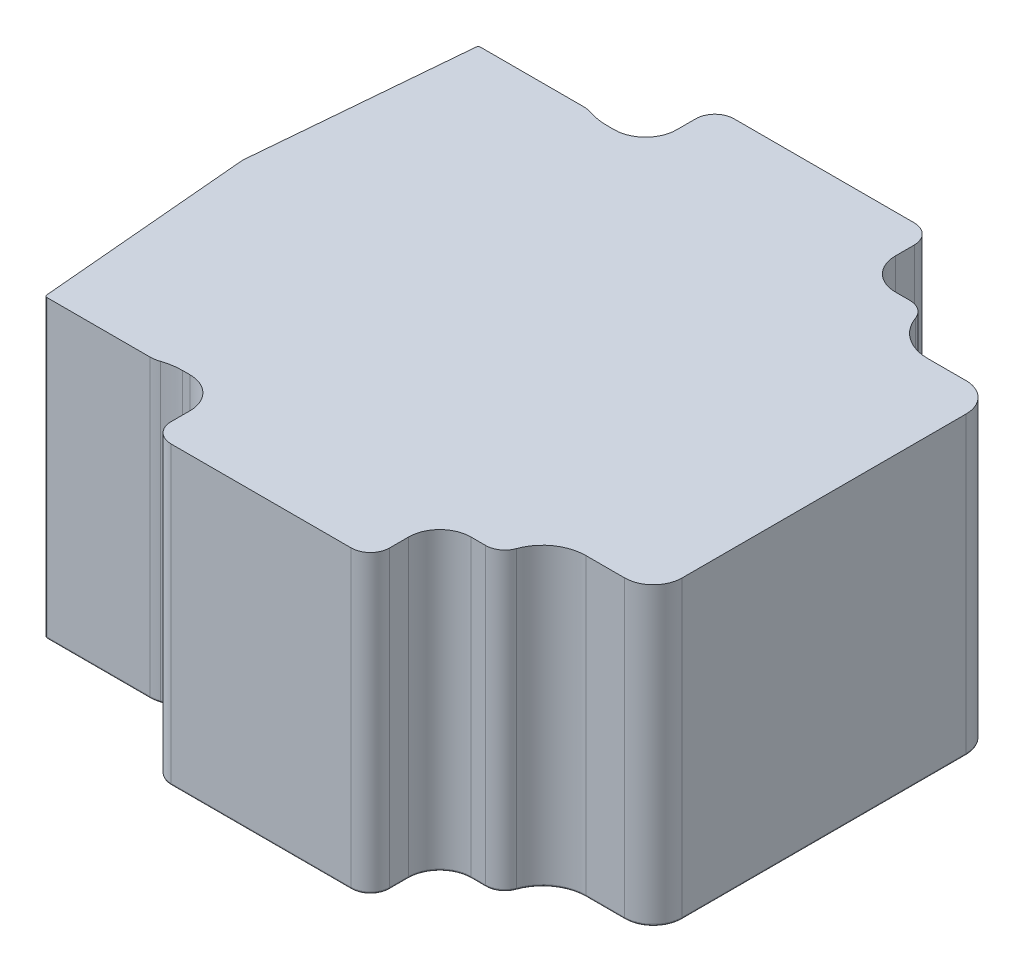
ISO-10303-21;
HEADER;
FILE_DESCRIPTION(('STEP AP214'),'2;1');
FILE_NAME('part.step','',(''),(''),'','','');
FILE_SCHEMA(('AUTOMOTIVE_DESIGN { 1 0 10303 214 1 1 1 1 }'));
ENDSEC;
DATA;
#1=APPLICATION_CONTEXT('core data for automotive mechanical design processes');
#2=APPLICATION_PROTOCOL_DEFINITION('international standard','automotive_design',2000,#1);
#3=PRODUCT_CONTEXT('',#1,'mechanical');
#4=PRODUCT('Part','Part','',(#3));
#5=PRODUCT_RELATED_PRODUCT_CATEGORY('part','',(#4));
#6=PRODUCT_DEFINITION_FORMATION('','',#4);
#7=PRODUCT_DEFINITION_CONTEXT('part definition',#1,'design');
#8=PRODUCT_DEFINITION('design','',#6,#7);
#9=PRODUCT_DEFINITION_SHAPE('','',#8);
#10=(LENGTH_UNIT() NAMED_UNIT(*) SI_UNIT(.MILLI.,.METRE.));
#11=(NAMED_UNIT(*) PLANE_ANGLE_UNIT() SI_UNIT($,.RADIAN.));
#12=(NAMED_UNIT(*) SI_UNIT($,.STERADIAN.) SOLID_ANGLE_UNIT());
#13=UNCERTAINTY_MEASURE_WITH_UNIT(LENGTH_MEASURE(1.E-05),#10,'distance_accuracy_value','');
#14=(GEOMETRIC_REPRESENTATION_CONTEXT(3) GLOBAL_UNCERTAINTY_ASSIGNED_CONTEXT((#13)) GLOBAL_UNIT_ASSIGNED_CONTEXT((#10,
#11,#12)) REPRESENTATION_CONTEXT('',''));
#15=CARTESIAN_POINT('',(0.,0.,0.));
#16=DIRECTION('',(0.,0.,1.));
#17=DIRECTION('',(1.,0.,0.));
#18=AXIS2_PLACEMENT_3D('',#15,#16,#17);
#19=CARTESIAN_POINT('',(29.3,30.,-29.3));
#20=DIRECTION('',(0.,0.,1.));
#21=DIRECTION('',(1.,0.,0.));
#22=AXIS2_PLACEMENT_3D('',#19,#20,#21);
#23=PLANE('',#22);
#24=DIRECTION('',(0.,-1.,0.));
#25=VECTOR('',#24,1.);
#26=CARTESIAN_POINT('',(9.37500000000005,30.,-29.3));
#27=LINE('',#26,#25);
#28=CARTESIAN_POINT('',(9.37500000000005,30.,-29.3));
#29=VERTEX_POINT('',#28);
#30=CARTESIAN_POINT('',(9.37500000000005,-0.6,-29.3));
#31=VERTEX_POINT('',#30);
#32=EDGE_CURVE('E509',#29,#31,#27,.T.);
#33=ORIENTED_EDGE('',*,*,#32,.T.);
#34=DIRECTION('',(-1.,0.,0.));
#35=VECTOR('',#34,1.);
#36=CARTESIAN_POINT('',(-9.37500000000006,-0.6,-29.3));
#37=LINE('',#36,#35);
#38=CARTESIAN_POINT('',(-9.37500000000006,-0.6,-29.3));
#39=VERTEX_POINT('',#38);
#40=EDGE_CURVE('E713',#31,#39,#37,.T.);
#41=ORIENTED_EDGE('',*,*,#40,.T.);
#42=DIRECTION('',(0.,1.,0.));
#43=VECTOR('',#42,1.);
#44=CARTESIAN_POINT('',(-9.37500000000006,30.,-29.3));
#45=LINE('',#44,#43);
#46=CARTESIAN_POINT('',(-9.37500000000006,30.,-29.3));
#47=VERTEX_POINT('',#46);
#48=EDGE_CURVE('E512',#39,#47,#45,.T.);
#49=ORIENTED_EDGE('',*,*,#48,.T.);
#50=DIRECTION('',(-1.,0.,0.));
#51=VECTOR('',#50,1.);
#52=CARTESIAN_POINT('',(29.3,30.,-29.3));
#53=LINE('',#52,#51);
#54=EDGE_CURVE('E474',#29,#47,#53,.T.);
#55=ORIENTED_EDGE('',*,*,#54,.F.);
#56=EDGE_LOOP('',(#33,#41,#49,#55));
#57=FACE_BOUND('',#56,.T.);
#58=ADVANCED_FACE('F17',(#57),#23,.F.);
#59=CARTESIAN_POINT('',(-33.,30.,29.3));
#60=DIRECTION('',(0.,0.,-1.));
#61=DIRECTION('',(-1.,0.,0.));
#62=AXIS2_PLACEMENT_3D('',#59,#60,#61);
#63=PLANE('',#62);
#64=DIRECTION('',(0.,-1.,0.));
#65=VECTOR('',#64,1.);
#66=CARTESIAN_POINT('',(-9.37500000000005,30.,29.3));
#67=LINE('',#66,#65);
#68=CARTESIAN_POINT('',(-9.37500000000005,30.,29.3));
#69=VERTEX_POINT('',#68);
#70=CARTESIAN_POINT('',(-9.37500000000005,-0.6,29.3));
#71=VERTEX_POINT('',#70);
#72=EDGE_CURVE('E493',#69,#71,#67,.T.);
#73=ORIENTED_EDGE('',*,*,#72,.T.);
#74=DIRECTION('',(1.,0.,0.));
#75=VECTOR('',#74,1.);
#76=CARTESIAN_POINT('',(9.37500000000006,-0.6,29.3));
#77=LINE('',#76,#75);
#78=CARTESIAN_POINT('',(9.37500000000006,-0.6,29.3));
#79=VERTEX_POINT('',#78);
#80=EDGE_CURVE('E677',#71,#79,#77,.T.);
#81=ORIENTED_EDGE('',*,*,#80,.T.);
#82=DIRECTION('',(0.,1.,0.));
#83=VECTOR('',#82,1.);
#84=CARTESIAN_POINT('',(9.37500000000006,30.,29.3));
#85=LINE('',#84,#83);
#86=CARTESIAN_POINT('',(9.37500000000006,30.,29.3));
#87=VERTEX_POINT('',#86);
#88=EDGE_CURVE('E491',#79,#87,#85,.T.);
#89=ORIENTED_EDGE('',*,*,#88,.T.);
#90=DIRECTION('',(1.,0.,0.));
#91=VECTOR('',#90,1.);
#92=CARTESIAN_POINT('',(-33.,30.,29.3));
#93=LINE('',#92,#91);
#94=EDGE_CURVE('E485',#69,#87,#93,.T.);
#95=ORIENTED_EDGE('',*,*,#94,.F.);
#96=EDGE_LOOP('',(#73,#81,#89,#95));
#97=FACE_BOUND('',#96,.T.);
#98=ADVANCED_FACE('F910',(#97),#63,.F.);
#99=CARTESIAN_POINT('',(29.3,30.,29.3));
#100=DIRECTION('',(-1.,0.,0.));
#101=DIRECTION('',(0.,0.,1.));
#102=AXIS2_PLACEMENT_3D('',#99,#100,#101);
#103=PLANE('',#102);
#104=DIRECTION('',(0.,1.,0.));
#105=VECTOR('',#104,1.);
#106=CARTESIAN_POINT('',(29.3,-0.799999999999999,14.7738636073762));
#107=LINE('',#106,#105);
#108=CARTESIAN_POINT('',(29.3,-0.6,14.7738636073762));
#109=VERTEX_POINT('',#108);
#110=CARTESIAN_POINT('',(29.3,30.,14.7738636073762));
#111=VERTEX_POINT('',#110);
#112=EDGE_CURVE('E479',#109,#111,#107,.T.);
#113=ORIENTED_EDGE('',*,*,#112,.F.);
#114=DIRECTION('',(0.,0.,-1.));
#115=VECTOR('',#114,1.);
#116=CARTESIAN_POINT('',(29.3,-0.6,-14.7738636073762));
#117=LINE('',#116,#115);
#118=CARTESIAN_POINT('',(29.3,-0.6,-14.7738636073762));
#119=VERTEX_POINT('',#118);
#120=EDGE_CURVE('E695',#109,#119,#117,.T.);
#121=ORIENTED_EDGE('',*,*,#120,.T.);
#122=DIRECTION('',(0.,1.,0.));
#123=VECTOR('',#122,1.);
#124=CARTESIAN_POINT('',(29.3,-0.799999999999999,-14.7738636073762));
#125=LINE('',#124,#123);
#126=CARTESIAN_POINT('',(29.3,30.,-14.7738636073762));
#127=VERTEX_POINT('',#126);
#128=EDGE_CURVE('E477',#119,#127,#125,.T.);
#129=ORIENTED_EDGE('',*,*,#128,.T.);
#130=DIRECTION('',(0.,0.,-1.));
#131=VECTOR('',#130,1.);
#132=CARTESIAN_POINT('',(29.3,30.,29.3));
#133=LINE('',#132,#131);
#134=EDGE_CURVE('E488',#111,#127,#133,.T.);
#135=ORIENTED_EDGE('',*,*,#134,.F.);
#136=EDGE_LOOP('',(#113,#121,#129,#135));
#137=FACE_BOUND('',#136,.T.);
#138=ADVANCED_FACE('F916',(#137),#103,.F.);
#139=CARTESIAN_POINT('',(29.3,30.,-29.3));
#140=DIRECTION('',(0.,-1.,0.));
#141=DIRECTION('',(0.,0.,-1.));
#142=AXIS2_PLACEMENT_3D('',#139,#140,#141);
#143=PLANE('',#142);
#144=CARTESIAN_POINT('',(-15.4189230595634,30.,-28.0812430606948));
#145=DIRECTION('',(0.,-1.,0.));
#146=DIRECTION('',(0.,0.,-1.));
#147=AXIS2_PLACEMENT_3D('',#144,#145,#146);
#148=CIRCLE('',#147,6.);
#149=CARTESIAN_POINT('',(-15.4189230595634,30.,-22.0812430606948));
#150=VERTEX_POINT('',#149);
#151=CARTESIAN_POINT('',(-17.3548440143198,30.,-22.4021401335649));
#152=VERTEX_POINT('',#151);
#153=EDGE_CURVE('E560',#150,#152,#148,.T.);
#154=ORIENTED_EDGE('',*,*,#153,.T.);
#155=CARTESIAN_POINT('',(-18.322804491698,30.,-19.56258867));
#156=DIRECTION('',(0.,-1.,0.));
#157=DIRECTION('',(0.,0.,-1.));
#158=AXIS2_PLACEMENT_3D('',#155,#156,#157);
#159=CIRCLE('',#158,3.);
#160=CARTESIAN_POINT('',(-18.322804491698,30.,-22.56258867));
#161=VERTEX_POINT('',#160);
#162=EDGE_CURVE('E566',#152,#161,#159,.F.);
#163=ORIENTED_EDGE('',*,*,#162,.T.);
#164=DIRECTION('',(-1.,0.,0.));
#165=VECTOR('',#164,1.);
#166=CARTESIAN_POINT('',(-17.77358943,30.,-22.56258867));
#167=LINE('',#166,#165);
#168=CARTESIAN_POINT('',(-29.0209173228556,30.,-22.56258867));
#169=VERTEX_POINT('',#168);
#170=EDGE_CURVE('E465',#161,#169,#167,.T.);
#171=ORIENTED_EDGE('',*,*,#170,.T.);
#172=CARTESIAN_POINT('',(-29.0209173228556,30.,-22.31258867));
#173=DIRECTION('',(0.,-1.,0.));
#174=DIRECTION('',(0.,0.,-1.));
#175=AXIS2_PLACEMENT_3D('',#172,#173,#174);
#176=CIRCLE('',#175,0.25);
#177=CARTESIAN_POINT('',(-29.2699659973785,30.,-22.3343776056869));
#178=VERTEX_POINT('',#177);
#179=EDGE_CURVE('E535',#169,#178,#176,.F.);
#180=ORIENTED_EDGE('',*,*,#179,.T.);
#181=DIRECTION('',(0.0871557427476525,0.,-0.996194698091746));
#182=VECTOR('',#181,1.);
#183=CARTESIAN_POINT('',(-29.25,30.,-22.56259));
#184=LINE('',#183,#182);
#185=CARTESIAN_POINT('',(-31.2010954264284,30.,-0.261467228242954));
#186=VERTEX_POINT('',#185);
#187=EDGE_CURVE('E396',#186,#178,#184,.T.);
#188=ORIENTED_EDGE('',*,*,#187,.F.);
#189=CARTESIAN_POINT('',(-28.2125113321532,30.,0.));
#190=DIRECTION('',(0.,-1.,0.));
#191=DIRECTION('',(0.,0.,-1.));
#192=AXIS2_PLACEMENT_3D('',#189,#190,#191);
#193=CIRCLE('',#192,3.);
#194=CARTESIAN_POINT('',(-31.2010954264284,30.,0.261467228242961));
#195=VERTEX_POINT('',#194);
#196=EDGE_CURVE('E548',#186,#195,#193,.F.);
#197=ORIENTED_EDGE('',*,*,#196,.T.);
#198=DIRECTION('',(-0.0871557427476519,0.,-0.996194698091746));
#199=VECTOR('',#198,1.);
#200=CARTESIAN_POINT('',(-29.25,30.,22.56259));
#201=LINE('',#200,#199);
#202=CARTESIAN_POINT('',(-29.2699659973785,30.,22.3343776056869));
#203=VERTEX_POINT('',#202);
#204=EDGE_CURVE('E891',#203,#195,#201,.T.);
#205=ORIENTED_EDGE('',*,*,#204,.F.);
#206=CARTESIAN_POINT('',(-29.0209173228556,30.,22.31258867));
#207=DIRECTION('',(0.,-1.,0.));
#208=DIRECTION('',(0.,0.,-1.));
#209=AXIS2_PLACEMENT_3D('',#206,#207,#208);
#210=CIRCLE('',#209,0.25);
#211=CARTESIAN_POINT('',(-29.0209173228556,30.,22.56258867));
#212=VERTEX_POINT('',#211);
#213=EDGE_CURVE('E533',#203,#212,#210,.F.);
#214=ORIENTED_EDGE('',*,*,#213,.T.);
#215=DIRECTION('',(1.,0.,0.));
#216=VECTOR('',#215,1.);
#217=CARTESIAN_POINT('',(-17.77358943,30.,22.56258867));
#218=LINE('',#217,#216);
#219=CARTESIAN_POINT('',(-18.322804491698,30.,22.56258867));
#220=VERTEX_POINT('',#219);
#221=EDGE_CURVE('E468',#212,#220,#218,.T.);
#222=ORIENTED_EDGE('',*,*,#221,.T.);
#223=CARTESIAN_POINT('',(-18.322804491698,30.,19.56258867));
#224=DIRECTION('',(0.,-1.,0.));
#225=DIRECTION('',(0.,0.,-1.));
#226=AXIS2_PLACEMENT_3D('',#223,#224,#225);
#227=CIRCLE('',#226,3.);
#228=CARTESIAN_POINT('',(-17.3548440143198,30.,22.4021401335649));
#229=VERTEX_POINT('',#228);
#230=EDGE_CURVE('E564',#220,#229,#227,.F.);
#231=ORIENTED_EDGE('',*,*,#230,.T.);
#232=CARTESIAN_POINT('',(-15.4189230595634,30.,28.0812430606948));
#233=DIRECTION('',(0.,-1.,0.));
#234=DIRECTION('',(0.,0.,-1.));
#235=AXIS2_PLACEMENT_3D('',#232,#233,#234);
#236=CIRCLE('',#235,6.);
#237=CARTESIAN_POINT('',(-15.4189230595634,30.,22.0812430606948));
#238=VERTEX_POINT('',#237);
#239=EDGE_CURVE('E558',#229,#238,#236,.T.);
#240=ORIENTED_EDGE('',*,*,#239,.T.);
#241=DIRECTION('',(-1.,0.,0.));
#242=VECTOR('',#241,1.);
#243=CARTESIAN_POINT('',(-17.77358943,30.,22.0812430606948));
#244=LINE('',#243,#242);
#245=CARTESIAN_POINT('',(-14.625,30.,22.0812430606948));
#246=VERTEX_POINT('',#245);
#247=EDGE_CURVE('E411',#246,#238,#244,.T.);
#248=ORIENTED_EDGE('',*,*,#247,.F.);
#249=CARTESIAN_POINT('',(-14.6250000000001,30.,25.3312430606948));
#250=DIRECTION('',(0.,1.,0.));
#251=DIRECTION('',(0.,0.,1.));
#252=AXIS2_PLACEMENT_3D('',#249,#250,#251);
#253=CIRCLE('',#252,3.25);
#254=CARTESIAN_POINT('',(-11.375,30.,25.3312430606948));
#255=VERTEX_POINT('',#254);
#256=EDGE_CURVE('E407',#255,#246,#253,.T.);
#257=ORIENTED_EDGE('',*,*,#256,.F.);
#258=DIRECTION('',(0.,0.,-1.));
#259=VECTOR('',#258,1.);
#260=CARTESIAN_POINT('',(-11.375,30.,32.8001981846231));
#261=LINE('',#260,#259);
#262=CARTESIAN_POINT('',(-11.375,30.,27.3));
#263=VERTEX_POINT('',#262);
#264=EDGE_CURVE('E414',#263,#255,#261,.T.);
#265=ORIENTED_EDGE('',*,*,#264,.F.);
#266=CARTESIAN_POINT('',(-9.37500000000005,30.,27.3));
#267=DIRECTION('',(0.,-1.,0.));
#268=DIRECTION('',(0.,0.,-1.));
#269=AXIS2_PLACEMENT_3D('',#266,#267,#268);
#270=CIRCLE('',#269,2.);
#271=EDGE_CURVE('E507',#263,#69,#270,.F.);
#272=ORIENTED_EDGE('',*,*,#271,.T.);
#273=ORIENTED_EDGE('',*,*,#94,.T.);
#274=CARTESIAN_POINT('',(9.37500000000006,30.,27.3));
#275=DIRECTION('',(0.,-1.,0.));
#276=DIRECTION('',(0.,0.,-1.));
#277=AXIS2_PLACEMENT_3D('',#274,#275,#276);
#278=CIRCLE('',#277,2.);
#279=CARTESIAN_POINT('',(11.3750000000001,30.,27.3));
#280=VERTEX_POINT('',#279);
#281=EDGE_CURVE('E498',#87,#280,#278,.F.);
#282=ORIENTED_EDGE('',*,*,#281,.T.);
#283=DIRECTION('',(0.,0.,1.));
#284=VECTOR('',#283,1.);
#285=CARTESIAN_POINT('',(11.3750000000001,30.,32.8001981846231));
#286=LINE('',#285,#284);
#287=CARTESIAN_POINT('',(11.3750000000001,30.,25.3312430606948));
#288=VERTEX_POINT('',#287);
#289=EDGE_CURVE('E424',#288,#280,#286,.T.);
#290=ORIENTED_EDGE('',*,*,#289,.F.);
#291=CARTESIAN_POINT('',(14.6250000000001,30.,25.3312430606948));
#292=DIRECTION('',(0.,1.,0.));
#293=DIRECTION('',(0.,0.,-1.));
#294=AXIS2_PLACEMENT_3D('',#291,#292,#293);
#295=CIRCLE('',#294,3.25);
#296=CARTESIAN_POINT('',(14.6250000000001,30.,22.0812430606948));
#297=VERTEX_POINT('',#296);
#298=EDGE_CURVE('E420',#297,#288,#295,.T.);
#299=ORIENTED_EDGE('',*,*,#298,.F.);
#300=DIRECTION('',(-1.,0.,0.));
#301=VECTOR('',#300,1.);
#302=CARTESIAN_POINT('',(17.77358943,30.,22.0812430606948));
#303=LINE('',#302,#301);
#304=CARTESIAN_POINT('',(16.1548428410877,30.,22.0812430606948));
#305=VERTEX_POINT('',#304);
#306=EDGE_CURVE('E427',#305,#297,#303,.T.);
#307=ORIENTED_EDGE('',*,*,#306,.F.);
#308=CARTESIAN_POINT('',(16.1548428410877,30.,20.0812430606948));
#309=DIRECTION('',(0.,-1.,0.));
#310=DIRECTION('',(0.,0.,-1.));
#311=AXIS2_PLACEMENT_3D('',#308,#309,#310);
#312=CIRCLE('',#311,2.);
#313=CARTESIAN_POINT('',(18.0376184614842,30.,20.7558955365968));
#314=VERTEX_POINT('',#313);
#315=EDGE_CURVE('E500',#305,#314,#312,.F.);
#316=ORIENTED_EDGE('',*,*,#315,.T.);
#317=CARTESIAN_POINT('',(22.2738636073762,30.,22.2738636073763));
#318=DIRECTION('',(0.,-1.,0.));
#319=DIRECTION('',(0.,0.,-1.));
#320=AXIS2_PLACEMENT_3D('',#317,#318,#319);
#321=CIRCLE('',#320,4.5);
#322=CARTESIAN_POINT('',(22.2738636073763,30.,17.7738636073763));
#323=VERTEX_POINT('',#322);
#324=EDGE_CURVE('E446',#314,#323,#321,.T.);
#325=ORIENTED_EDGE('',*,*,#324,.T.);
#326=DIRECTION('',(1.,0.,0.));
#327=VECTOR('',#326,1.);
#328=CARTESIAN_POINT('',(22.2738636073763,30.,17.7738636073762));
#329=LINE('',#328,#327);
#330=CARTESIAN_POINT('',(26.3,30.,17.7738636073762));
#331=VERTEX_POINT('',#330);
#332=EDGE_CURVE('E450',#323,#331,#329,.T.);
#333=ORIENTED_EDGE('',*,*,#332,.T.);
#334=CARTESIAN_POINT('',(26.3,30.,14.7738636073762));
#335=DIRECTION('',(0.,1.,0.));
#336=DIRECTION('',(0.,0.,-1.));
#337=AXIS2_PLACEMENT_3D('',#334,#335,#336);
#338=CIRCLE('',#337,3.);
#339=EDGE_CURVE('E453',#331,#111,#338,.T.);
#340=ORIENTED_EDGE('',*,*,#339,.T.);
#341=ORIENTED_EDGE('',*,*,#134,.T.);
#342=CARTESIAN_POINT('',(26.3,30.,-14.7738636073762));
#343=DIRECTION('',(0.,1.,0.));
#344=DIRECTION('',(0.,0.,1.));
#345=AXIS2_PLACEMENT_3D('',#342,#343,#344);
#346=CIRCLE('',#345,3.);
#347=CARTESIAN_POINT('',(26.3,30.,-17.7738636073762));
#348=VERTEX_POINT('',#347);
#349=EDGE_CURVE('E456',#127,#348,#346,.T.);
#350=ORIENTED_EDGE('',*,*,#349,.T.);
#351=DIRECTION('',(-1.,0.,0.));
#352=VECTOR('',#351,1.);
#353=CARTESIAN_POINT('',(22.2738636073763,30.,-17.7738636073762));
#354=LINE('',#353,#352);
#355=CARTESIAN_POINT('',(22.2738636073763,30.,-17.7738636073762));
#356=VERTEX_POINT('',#355);
#357=EDGE_CURVE('E459',#348,#356,#354,.T.);
#358=ORIENTED_EDGE('',*,*,#357,.T.);
#359=CARTESIAN_POINT('',(22.2738636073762,30.,-22.2738636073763));
#360=DIRECTION('',(0.,-1.,0.));
#361=DIRECTION('',(0.,0.,1.));
#362=AXIS2_PLACEMENT_3D('',#359,#360,#361);
#363=CIRCLE('',#362,4.5);
#364=CARTESIAN_POINT('',(18.0376184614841,30.,-20.7558955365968));
#365=VERTEX_POINT('',#364);
#366=EDGE_CURVE('E462',#356,#365,#363,.T.);
#367=ORIENTED_EDGE('',*,*,#366,.T.);
#368=CARTESIAN_POINT('',(16.1548428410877,30.,-20.0812430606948));
#369=DIRECTION('',(0.,-1.,0.));
#370=DIRECTION('',(0.,0.,-1.));
#371=AXIS2_PLACEMENT_3D('',#368,#369,#370);
#372=CIRCLE('',#371,2.);
#373=CARTESIAN_POINT('',(16.1548428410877,30.,-22.0812430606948));
#374=VERTEX_POINT('',#373);
#375=EDGE_CURVE('E504',#365,#374,#372,.F.);
#376=ORIENTED_EDGE('',*,*,#375,.T.);
#377=DIRECTION('',(1.,0.,0.));
#378=VECTOR('',#377,1.);
#379=CARTESIAN_POINT('',(17.77358943,30.,-22.0812430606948));
#380=LINE('',#379,#378);
#381=CARTESIAN_POINT('',(14.625,30.,-22.0812430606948));
#382=VERTEX_POINT('',#381);
#383=EDGE_CURVE('E440',#382,#374,#380,.T.);
#384=ORIENTED_EDGE('',*,*,#383,.F.);
#385=CARTESIAN_POINT('',(14.625,30.,-25.3312430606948));
#386=DIRECTION('',(0.,1.,0.));
#387=DIRECTION('',(0.,0.,1.));
#388=AXIS2_PLACEMENT_3D('',#385,#386,#387);
#389=CIRCLE('',#388,3.25);
#390=CARTESIAN_POINT('',(11.375,30.,-25.3312430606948));
#391=VERTEX_POINT('',#390);
#392=EDGE_CURVE('E437',#391,#382,#389,.T.);
#393=ORIENTED_EDGE('',*,*,#392,.F.);
#394=DIRECTION('',(0.,0.,1.));
#395=VECTOR('',#394,1.);
#396=CARTESIAN_POINT('',(11.375,30.,-32.8001981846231));
#397=LINE('',#396,#395);
#398=CARTESIAN_POINT('',(11.375,30.,-27.3));
#399=VERTEX_POINT('',#398);
#400=EDGE_CURVE('E433',#399,#391,#397,.T.);
#401=ORIENTED_EDGE('',*,*,#400,.F.);
#402=CARTESIAN_POINT('',(9.37500000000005,30.,-27.3));
#403=DIRECTION('',(0.,-1.,0.));
#404=DIRECTION('',(0.,0.,-1.));
#405=AXIS2_PLACEMENT_3D('',#402,#403,#404);
#406=CIRCLE('',#405,2.);
#407=EDGE_CURVE('E502',#399,#29,#406,.F.);
#408=ORIENTED_EDGE('',*,*,#407,.T.);
#409=ORIENTED_EDGE('',*,*,#54,.T.);
#410=CARTESIAN_POINT('',(-9.37500000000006,30.,-27.3));
#411=DIRECTION('',(0.,-1.,0.));
#412=DIRECTION('',(0.,0.,-1.));
#413=AXIS2_PLACEMENT_3D('',#410,#411,#412);
#414=CIRCLE('',#413,2.);
#415=CARTESIAN_POINT('',(-11.3750000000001,30.,-27.3));
#416=VERTEX_POINT('',#415);
#417=EDGE_CURVE('E402',#47,#416,#414,.F.);
#418=ORIENTED_EDGE('',*,*,#417,.T.);
#419=DIRECTION('',(0.,0.,-1.));
#420=VECTOR('',#419,1.);
#421=CARTESIAN_POINT('',(-11.3750000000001,30.,-32.8001981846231));
#422=LINE('',#421,#420);
#423=CARTESIAN_POINT('',(-11.3750000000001,30.,-25.3312430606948));
#424=VERTEX_POINT('',#423);
#425=EDGE_CURVE('E380',#424,#416,#422,.T.);
#426=ORIENTED_EDGE('',*,*,#425,.F.);
#427=CARTESIAN_POINT('',(-14.625,30.,-25.3312430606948));
#428=DIRECTION('',(0.,1.,0.));
#429=DIRECTION('',(0.,0.,-1.));
#430=AXIS2_PLACEMENT_3D('',#427,#428,#429);
#431=CIRCLE('',#430,3.25);
#432=CARTESIAN_POINT('',(-14.625,30.,-22.0812430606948));
#433=VERTEX_POINT('',#432);
#434=EDGE_CURVE('E390',#433,#424,#431,.T.);
#435=ORIENTED_EDGE('',*,*,#434,.F.);
#436=DIRECTION('',(1.,0.,0.));
#437=VECTOR('',#436,1.);
#438=CARTESIAN_POINT('',(-17.77358943,30.,-22.0812430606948));
#439=LINE('',#438,#437);
#440=EDGE_CURVE('E387',#150,#433,#439,.T.);
#441=ORIENTED_EDGE('',*,*,#440,.F.);
#442=EDGE_LOOP('',(#154,#163,#171,#180,#188,#197,#205,#214,#222,#231,#240,#248,#257,#265,#272,
#273,#282,#290,#299,#307,#316,#325,#333,#340,#341,#350,#358,#367,#376,#384,#393,#401,#408,#409,
#418,#426,#435,#441));
#443=FACE_BOUND('',#442,.T.);
#444=ADVANCED_FACE('F399',(#443),#143,.F.);
#445=CARTESIAN_POINT('',(29.3,-0.8,-29.3));
#446=DIRECTION('',(0.,-1.,0.));
#447=DIRECTION('',(0.,0.,-1.));
#448=AXIS2_PLACEMENT_3D('',#445,#446,#447);
#449=PLANE('',#448);
#450=DIRECTION('',(0.0871557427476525,0.,-0.996194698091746));
#451=VECTOR('',#450,1.);
#452=CARTESIAN_POINT('',(-29.0707270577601,-0.8,-22.3169464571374));
#453=LINE('',#452,#451);
#454=CARTESIAN_POINT('',(-31.0018564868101,-0.8,-0.244036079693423));
#455=VERTEX_POINT('',#454);
#456=CARTESIAN_POINT('',(-29.0707270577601,-0.8,-22.3169464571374));
#457=VERTEX_POINT('',#456);
#458=EDGE_CURVE('E647',#455,#457,#453,.T.);
#459=ORIENTED_EDGE('',*,*,#458,.T.);
#460=CARTESIAN_POINT('',(-29.0209173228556,-0.8,-22.31258867));
#461=DIRECTION('',(0.,-1.,0.));
#462=DIRECTION('',(0.,0.,-1.));
#463=AXIS2_PLACEMENT_3D('',#460,#461,#462);
#464=CIRCLE('',#463,0.05);
#465=CARTESIAN_POINT('',(-29.0209173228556,-0.8,-22.36258867));
#466=VERTEX_POINT('',#465);
#467=EDGE_CURVE('E649',#457,#466,#464,.T.);
#468=ORIENTED_EDGE('',*,*,#467,.T.);
#469=DIRECTION('',(-1.,0.,0.));
#470=VECTOR('',#469,1.);
#471=CARTESIAN_POINT('',(29.3,-0.8,-22.36258867));
#472=LINE('',#471,#470);
#473=CARTESIAN_POINT('',(-18.322804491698,-0.8,-22.36258867));
#474=VERTEX_POINT('',#473);
#475=EDGE_CURVE('E575',#466,#474,#472,.F.);
#476=ORIENTED_EDGE('',*,*,#475,.T.);
#477=CARTESIAN_POINT('',(-18.322804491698,-0.8,-19.56258867));
#478=DIRECTION('',(0.,-1.,0.));
#479=DIRECTION('',(0.,0.,-1.));
#480=AXIS2_PLACEMENT_3D('',#477,#478,#479);
#481=CIRCLE('',#480,2.8);
#482=CARTESIAN_POINT('',(-17.4193747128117,-0.8,-22.2128367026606));
#483=VERTEX_POINT('',#482);
#484=EDGE_CURVE('E577',#474,#483,#481,.T.);
#485=ORIENTED_EDGE('',*,*,#484,.T.);
#486=CARTESIAN_POINT('',(-15.4189230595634,-0.8,-28.0812430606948));
#487=DIRECTION('',(0.,-1.,0.));
#488=DIRECTION('',(0.,0.,-1.));
#489=AXIS2_PLACEMENT_3D('',#486,#487,#488);
#490=CIRCLE('',#489,6.2);
#491=CARTESIAN_POINT('',(-15.4189230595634,-0.8,-21.8812430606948));
#492=VERTEX_POINT('',#491);
#493=EDGE_CURVE('E579',#483,#492,#490,.F.);
#494=ORIENTED_EDGE('',*,*,#493,.T.);
#495=DIRECTION('',(1.,0.,0.));
#496=VECTOR('',#495,1.);
#497=CARTESIAN_POINT('',(-14.625,-0.8,-21.8812430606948));
#498=LINE('',#497,#496);
#499=CARTESIAN_POINT('',(-14.625,-0.8,-21.8812430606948));
#500=VERTEX_POINT('',#499);
#501=EDGE_CURVE('E581',#492,#500,#498,.T.);
#502=ORIENTED_EDGE('',*,*,#501,.T.);
#503=CARTESIAN_POINT('',(-14.625,-0.8,-25.3312430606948));
#504=DIRECTION('',(0.,-1.,0.));
#505=DIRECTION('',(0.,0.,-1.));
#506=AXIS2_PLACEMENT_3D('',#503,#504,#505);
#507=CIRCLE('',#506,3.45);
#508=CARTESIAN_POINT('',(-11.175,-0.8,-25.3312430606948));
#509=VERTEX_POINT('',#508);
#510=EDGE_CURVE('E583',#500,#509,#507,.F.);
#511=ORIENTED_EDGE('',*,*,#510,.T.);
#512=DIRECTION('',(0.,0.,-1.));
#513=VECTOR('',#512,1.);
#514=CARTESIAN_POINT('',(-11.1750000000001,-0.8,-27.3));
#515=LINE('',#514,#513);
#516=CARTESIAN_POINT('',(-11.1750000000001,-0.8,-27.3));
#517=VERTEX_POINT('',#516);
#518=EDGE_CURVE('E585',#509,#517,#515,.T.);
#519=ORIENTED_EDGE('',*,*,#518,.T.);
#520=CARTESIAN_POINT('',(-9.37500000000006,-0.8,-27.3));
#521=DIRECTION('',(0.,-1.,0.));
#522=DIRECTION('',(0.,0.,-1.));
#523=AXIS2_PLACEMENT_3D('',#520,#521,#522);
#524=CIRCLE('',#523,1.8);
#525=CARTESIAN_POINT('',(-9.37500000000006,-0.8,-29.1));
#526=VERTEX_POINT('',#525);
#527=EDGE_CURVE('E587',#517,#526,#524,.T.);
#528=ORIENTED_EDGE('',*,*,#527,.T.);
#529=DIRECTION('',(-1.,0.,0.));
#530=VECTOR('',#529,1.);
#531=CARTESIAN_POINT('',(9.37500000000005,-0.8,-29.1));
#532=LINE('',#531,#530);
#533=CARTESIAN_POINT('',(9.37500000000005,-0.8,-29.1));
#534=VERTEX_POINT('',#533);
#535=EDGE_CURVE('E589',#526,#534,#532,.F.);
#536=ORIENTED_EDGE('',*,*,#535,.T.);
#537=CARTESIAN_POINT('',(9.37500000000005,-0.8,-27.3));
#538=DIRECTION('',(0.,-1.,0.));
#539=DIRECTION('',(0.,0.,-1.));
#540=AXIS2_PLACEMENT_3D('',#537,#538,#539);
#541=CIRCLE('',#540,1.8);
#542=CARTESIAN_POINT('',(11.175,-0.8,-27.3));
#543=VERTEX_POINT('',#542);
#544=EDGE_CURVE('E591',#534,#543,#541,.T.);
#545=ORIENTED_EDGE('',*,*,#544,.T.);
#546=DIRECTION('',(0.,0.,1.));
#547=VECTOR('',#546,1.);
#548=CARTESIAN_POINT('',(11.175,-0.8,-25.3312430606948));
#549=LINE('',#548,#547);
#550=CARTESIAN_POINT('',(11.175,-0.8,-25.3312430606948));
#551=VERTEX_POINT('',#550);
#552=EDGE_CURVE('E593',#543,#551,#549,.T.);
#553=ORIENTED_EDGE('',*,*,#552,.T.);
#554=CARTESIAN_POINT('',(14.625,-0.8,-25.3312430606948));
#555=DIRECTION('',(0.,-1.,0.));
#556=DIRECTION('',(0.,0.,-1.));
#557=AXIS2_PLACEMENT_3D('',#554,#555,#556);
#558=CIRCLE('',#557,3.45);
#559=CARTESIAN_POINT('',(14.625,-0.8,-21.8812430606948));
#560=VERTEX_POINT('',#559);
#561=EDGE_CURVE('E595',#551,#560,#558,.F.);
#562=ORIENTED_EDGE('',*,*,#561,.T.);
#563=DIRECTION('',(1.,0.,0.));
#564=VECTOR('',#563,1.);
#565=CARTESIAN_POINT('',(16.1548428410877,-0.8,-21.8812430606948));
#566=LINE('',#565,#564);
#567=CARTESIAN_POINT('',(16.1548428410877,-0.8,-21.8812430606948));
#568=VERTEX_POINT('',#567);
#569=EDGE_CURVE('E597',#560,#568,#566,.T.);
#570=ORIENTED_EDGE('',*,*,#569,.T.);
#571=CARTESIAN_POINT('',(16.1548428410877,-0.8,-20.0812430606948));
#572=DIRECTION('',(0.,-1.,0.));
#573=DIRECTION('',(0.,0.,-1.));
#574=AXIS2_PLACEMENT_3D('',#571,#572,#573);
#575=CIRCLE('',#574,1.8);
#576=CARTESIAN_POINT('',(17.8493408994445,-0.8,-20.6884302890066));
#577=VERTEX_POINT('',#576);
#578=EDGE_CURVE('E599',#568,#577,#575,.T.);
#579=ORIENTED_EDGE('',*,*,#578,.T.);
#580=CARTESIAN_POINT('',(22.2738636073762,-0.8,-22.2738636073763));
#581=DIRECTION('',(0.,-1.,0.));
#582=DIRECTION('',(0.,0.,-1.));
#583=AXIS2_PLACEMENT_3D('',#580,#581,#582);
#584=CIRCLE('',#583,4.7);
#585=CARTESIAN_POINT('',(22.2738636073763,-0.8,-17.5738636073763));
#586=VERTEX_POINT('',#585);
#587=EDGE_CURVE('E601',#577,#586,#584,.F.);
#588=ORIENTED_EDGE('',*,*,#587,.T.);
#589=DIRECTION('',(-1.,0.,0.));
#590=VECTOR('',#589,1.);
#591=CARTESIAN_POINT('',(29.3,-0.8,-17.5738636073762));
#592=LINE('',#591,#590);
#593=CARTESIAN_POINT('',(26.3,-0.8,-17.5738636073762));
#594=VERTEX_POINT('',#593);
#595=EDGE_CURVE('E603',#586,#594,#592,.F.);
#596=ORIENTED_EDGE('',*,*,#595,.T.);
#597=CARTESIAN_POINT('',(26.3,-0.8,-14.7738636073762));
#598=DIRECTION('',(0.,-1.,0.));
#599=DIRECTION('',(0.,0.,-1.));
#600=AXIS2_PLACEMENT_3D('',#597,#598,#599);
#601=CIRCLE('',#600,2.8);
#602=CARTESIAN_POINT('',(29.1,-0.8,-14.7738636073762));
#603=VERTEX_POINT('',#602);
#604=EDGE_CURVE('E605',#594,#603,#601,.T.);
#605=ORIENTED_EDGE('',*,*,#604,.T.);
#606=DIRECTION('',(0.,0.,-1.));
#607=VECTOR('',#606,1.);
#608=CARTESIAN_POINT('',(29.1,-0.8,14.7738636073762));
#609=LINE('',#608,#607);
#610=CARTESIAN_POINT('',(29.1,-0.8,14.7738636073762));
#611=VERTEX_POINT('',#610);
#612=EDGE_CURVE('E607',#603,#611,#609,.F.);
#613=ORIENTED_EDGE('',*,*,#612,.T.);
#614=CARTESIAN_POINT('',(26.3,-0.8,14.7738636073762));
#615=DIRECTION('',(0.,-1.,0.));
#616=DIRECTION('',(0.,0.,-1.));
#617=AXIS2_PLACEMENT_3D('',#614,#615,#616);
#618=CIRCLE('',#617,2.8);
#619=CARTESIAN_POINT('',(26.3,-0.8,17.5738636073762));
#620=VERTEX_POINT('',#619);
#621=EDGE_CURVE('E609',#611,#620,#618,.T.);
#622=ORIENTED_EDGE('',*,*,#621,.T.);
#623=DIRECTION('',(1.,0.,0.));
#624=VECTOR('',#623,1.);
#625=CARTESIAN_POINT('',(29.3,-0.8,17.5738636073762));
#626=LINE('',#625,#624);
#627=CARTESIAN_POINT('',(22.2738636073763,-0.8,17.5738636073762));
#628=VERTEX_POINT('',#627);
#629=EDGE_CURVE('E611',#620,#628,#626,.F.);
#630=ORIENTED_EDGE('',*,*,#629,.T.);
#631=CARTESIAN_POINT('',(22.2738636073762,-0.8,22.2738636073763));
#632=DIRECTION('',(0.,-1.,0.));
#633=DIRECTION('',(0.,0.,-1.));
#634=AXIS2_PLACEMENT_3D('',#631,#632,#633);
#635=CIRCLE('',#634,4.7);
#636=CARTESIAN_POINT('',(17.8493408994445,-0.8,20.6884302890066));
#637=VERTEX_POINT('',#636);
#638=EDGE_CURVE('E613',#628,#637,#635,.F.);
#639=ORIENTED_EDGE('',*,*,#638,.T.);
#640=CARTESIAN_POINT('',(16.1548428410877,-0.8,20.0812430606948));
#641=DIRECTION('',(0.,-1.,0.));
#642=DIRECTION('',(0.,0.,-1.));
#643=AXIS2_PLACEMENT_3D('',#640,#641,#642);
#644=CIRCLE('',#643,1.8);
#645=CARTESIAN_POINT('',(16.1548428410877,-0.8,21.8812430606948));
#646=VERTEX_POINT('',#645);
#647=EDGE_CURVE('E615',#637,#646,#644,.T.);
#648=ORIENTED_EDGE('',*,*,#647,.T.);
#649=DIRECTION('',(-1.,0.,0.));
#650=VECTOR('',#649,1.);
#651=CARTESIAN_POINT('',(14.6250000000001,-0.8,21.8812430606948));
#652=LINE('',#651,#650);
#653=CARTESIAN_POINT('',(14.6250000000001,-0.8,21.8812430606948));
#654=VERTEX_POINT('',#653);
#655=EDGE_CURVE('E617',#646,#654,#652,.T.);
#656=ORIENTED_EDGE('',*,*,#655,.T.);
#657=CARTESIAN_POINT('',(14.6250000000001,-0.8,25.3312430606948));
#658=DIRECTION('',(0.,-1.,0.));
#659=DIRECTION('',(0.,0.,-1.));
#660=AXIS2_PLACEMENT_3D('',#657,#658,#659);
#661=CIRCLE('',#660,3.45);
#662=CARTESIAN_POINT('',(11.1750000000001,-0.8,25.3312430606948));
#663=VERTEX_POINT('',#662);
#664=EDGE_CURVE('E619',#654,#663,#661,.F.);
#665=ORIENTED_EDGE('',*,*,#664,.T.);
#666=DIRECTION('',(0.,0.,1.));
#667=VECTOR('',#666,1.);
#668=CARTESIAN_POINT('',(11.1750000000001,-0.8,27.3));
#669=LINE('',#668,#667);
#670=CARTESIAN_POINT('',(11.1750000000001,-0.8,27.3));
#671=VERTEX_POINT('',#670);
#672=EDGE_CURVE('E621',#663,#671,#669,.T.);
#673=ORIENTED_EDGE('',*,*,#672,.T.);
#674=CARTESIAN_POINT('',(9.37500000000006,-0.8,27.3));
#675=DIRECTION('',(0.,-1.,0.));
#676=DIRECTION('',(0.,0.,-1.));
#677=AXIS2_PLACEMENT_3D('',#674,#675,#676);
#678=CIRCLE('',#677,1.8);
#679=CARTESIAN_POINT('',(9.37500000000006,-0.8,29.1));
#680=VERTEX_POINT('',#679);
#681=EDGE_CURVE('E623',#671,#680,#678,.T.);
#682=ORIENTED_EDGE('',*,*,#681,.T.);
#683=DIRECTION('',(1.,0.,0.));
#684=VECTOR('',#683,1.);
#685=CARTESIAN_POINT('',(-9.37500000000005,-0.8,29.1));
#686=LINE('',#685,#684);
#687=CARTESIAN_POINT('',(-9.37500000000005,-0.8,29.1));
#688=VERTEX_POINT('',#687);
#689=EDGE_CURVE('E625',#680,#688,#686,.F.);
#690=ORIENTED_EDGE('',*,*,#689,.T.);
#691=CARTESIAN_POINT('',(-9.37500000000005,-0.8,27.3));
#692=DIRECTION('',(0.,-1.,0.));
#693=DIRECTION('',(0.,0.,-1.));
#694=AXIS2_PLACEMENT_3D('',#691,#692,#693);
#695=CIRCLE('',#694,1.8);
#696=CARTESIAN_POINT('',(-11.175,-0.8,27.3));
#697=VERTEX_POINT('',#696);
#698=EDGE_CURVE('E627',#688,#697,#695,.T.);
#699=ORIENTED_EDGE('',*,*,#698,.T.);
#700=DIRECTION('',(0.,0.,-1.));
#701=VECTOR('',#700,1.);
#702=CARTESIAN_POINT('',(-11.175,-0.8,25.3312430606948));
#703=LINE('',#702,#701);
#704=CARTESIAN_POINT('',(-11.175,-0.8,25.3312430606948));
#705=VERTEX_POINT('',#704);
#706=EDGE_CURVE('E629',#697,#705,#703,.T.);
#707=ORIENTED_EDGE('',*,*,#706,.T.);
#708=CARTESIAN_POINT('',(-14.6250000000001,-0.8,25.3312430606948));
#709=DIRECTION('',(0.,-1.,0.));
#710=DIRECTION('',(0.,0.,-1.));
#711=AXIS2_PLACEMENT_3D('',#708,#709,#710);
#712=CIRCLE('',#711,3.45);
#713=CARTESIAN_POINT('',(-14.625,-0.8,21.8812430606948));
#714=VERTEX_POINT('',#713);
#715=EDGE_CURVE('E631',#705,#714,#712,.F.);
#716=ORIENTED_EDGE('',*,*,#715,.T.);
#717=DIRECTION('',(-1.,0.,0.));
#718=VECTOR('',#717,1.);
#719=CARTESIAN_POINT('',(-15.4189230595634,-0.8,21.8812430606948));
#720=LINE('',#719,#718);
#721=CARTESIAN_POINT('',(-15.4189230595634,-0.8,21.8812430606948));
#722=VERTEX_POINT('',#721);
#723=EDGE_CURVE('E633',#714,#722,#720,.T.);
#724=ORIENTED_EDGE('',*,*,#723,.T.);
#725=CARTESIAN_POINT('',(-15.4189230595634,-0.8,28.0812430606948));
#726=DIRECTION('',(0.,-1.,0.));
#727=DIRECTION('',(0.,0.,-1.));
#728=AXIS2_PLACEMENT_3D('',#725,#726,#727);
#729=CIRCLE('',#728,6.2);
#730=CARTESIAN_POINT('',(-17.4193747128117,-0.8,22.2128367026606));
#731=VERTEX_POINT('',#730);
#732=EDGE_CURVE('E635',#722,#731,#729,.F.);
#733=ORIENTED_EDGE('',*,*,#732,.T.);
#734=CARTESIAN_POINT('',(-18.322804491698,-0.8,19.56258867));
#735=DIRECTION('',(0.,-1.,0.));
#736=DIRECTION('',(0.,0.,-1.));
#737=AXIS2_PLACEMENT_3D('',#734,#735,#736);
#738=CIRCLE('',#737,2.8);
#739=CARTESIAN_POINT('',(-18.322804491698,-0.8,22.36258867));
#740=VERTEX_POINT('',#739);
#741=EDGE_CURVE('E637',#731,#740,#738,.T.);
#742=ORIENTED_EDGE('',*,*,#741,.T.);
#743=DIRECTION('',(1.,0.,0.));
#744=VECTOR('',#743,1.);
#745=CARTESIAN_POINT('',(29.3,-0.8,22.36258867));
#746=LINE('',#745,#744);
#747=CARTESIAN_POINT('',(-29.0209173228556,-0.8,22.36258867));
#748=VERTEX_POINT('',#747);
#749=EDGE_CURVE('E639',#740,#748,#746,.F.);
#750=ORIENTED_EDGE('',*,*,#749,.T.);
#751=CARTESIAN_POINT('',(-29.0209173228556,-0.8,22.31258867));
#752=DIRECTION('',(0.,-1.,0.));
#753=DIRECTION('',(0.,0.,-1.));
#754=AXIS2_PLACEMENT_3D('',#751,#752,#753);
#755=CIRCLE('',#754,0.05);
#756=CARTESIAN_POINT('',(-29.0707270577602,-0.8,22.3169464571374));
#757=VERTEX_POINT('',#756);
#758=EDGE_CURVE('E641',#748,#757,#755,.T.);
#759=ORIENTED_EDGE('',*,*,#758,.T.);
#760=DIRECTION('',(-0.0871557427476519,0.,-0.996194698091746));
#761=VECTOR('',#760,1.);
#762=CARTESIAN_POINT('',(-31.0018564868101,-0.8,0.244036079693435));
#763=LINE('',#762,#761);
#764=CARTESIAN_POINT('',(-31.0018564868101,-0.8,0.24403607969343));
#765=VERTEX_POINT('',#764);
#766=EDGE_CURVE('E643',#757,#765,#763,.T.);
#767=ORIENTED_EDGE('',*,*,#766,.T.);
#768=CARTESIAN_POINT('',(-28.2125113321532,-0.8,0.));
#769=DIRECTION('',(0.,-1.,0.));
#770=DIRECTION('',(0.,0.,-1.));
#771=AXIS2_PLACEMENT_3D('',#768,#769,#770);
#772=CIRCLE('',#771,2.8);
#773=EDGE_CURVE('E645',#765,#455,#772,.T.);
#774=ORIENTED_EDGE('',*,*,#773,.T.);
#775=EDGE_LOOP('',(#459,#468,#476,#485,#494,#502,#511,#519,#528,#536,#545,#553,#562,#570,#579,
#588,#596,#605,#613,#622,#630,#639,#648,#656,#665,#673,#682,#690,#699,#707,#716,#724,#733,#742,
#750,#759,#767,#774));
#776=FACE_BOUND('',#775,.T.);
#777=ADVANCED_FACE('F953',(#776),#449,.T.);
#778=CARTESIAN_POINT('',(22.2738636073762,-0.799999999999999,22.2738636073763));
#779=DIRECTION('',(0.,1.,0.));
#780=DIRECTION('',(0.,0.,1.));
#781=AXIS2_PLACEMENT_3D('',#778,#779,#780);
#782=CYLINDRICAL_SURFACE('',#781,4.5);
#783=DIRECTION('',(0.,1.,0.));
#784=VECTOR('',#783,1.);
#785=CARTESIAN_POINT('',(18.0376184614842,-0.799999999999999,20.7558955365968));
#786=LINE('',#785,#784);
#787=CARTESIAN_POINT('',(18.0376184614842,-0.6,20.7558955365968));
#788=VERTEX_POINT('',#787);
#789=EDGE_CURVE('E525',#314,#788,#786,.F.);
#790=ORIENTED_EDGE('',*,*,#789,.T.);
#791=CARTESIAN_POINT('',(22.2738636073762,-0.6,22.2738636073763));
#792=DIRECTION('',(0.,-1.,0.));
#793=DIRECTION('',(0.,0.,-1.));
#794=AXIS2_PLACEMENT_3D('',#791,#792,#793);
#795=CIRCLE('',#794,4.5);
#796=CARTESIAN_POINT('',(22.2738636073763,-0.6,17.7738636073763));
#797=VERTEX_POINT('',#796);
#798=EDGE_CURVE('E689',#788,#797,#795,.T.);
#799=ORIENTED_EDGE('',*,*,#798,.T.);
#800=DIRECTION('',(0.,1.,0.));
#801=VECTOR('',#800,1.);
#802=CARTESIAN_POINT('',(22.2738636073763,-0.799999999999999,17.7738636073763));
#803=LINE('',#802,#801);
#804=EDGE_CURVE('E471',#797,#323,#803,.T.);
#805=ORIENTED_EDGE('',*,*,#804,.T.);
#806=ORIENTED_EDGE('',*,*,#324,.F.);
#807=EDGE_LOOP('',(#790,#799,#805,#806));
#808=FACE_BOUND('',#807,.T.);
#809=ADVANCED_FACE('F1597',(#808),#782,.F.);
#810=CARTESIAN_POINT('',(22.2738636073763,-0.799999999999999,17.7738636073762));
#811=DIRECTION('',(0.,0.,1.));
#812=DIRECTION('',(1.,0.,0.));
#813=AXIS2_PLACEMENT_3D('',#810,#811,#812);
#814=PLANE('',#813);
#815=ORIENTED_EDGE('',*,*,#804,.F.);
#816=DIRECTION('',(1.,0.,0.));
#817=VECTOR('',#816,1.);
#818=CARTESIAN_POINT('',(22.2738636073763,-0.6,17.7738636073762));
#819=LINE('',#818,#817);
#820=CARTESIAN_POINT('',(26.3,-0.6,17.7738636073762));
#821=VERTEX_POINT('',#820);
#822=EDGE_CURVE('E691',#797,#821,#819,.T.);
#823=ORIENTED_EDGE('',*,*,#822,.T.);
#824=DIRECTION('',(0.,1.,0.));
#825=VECTOR('',#824,1.);
#826=CARTESIAN_POINT('',(26.3,-0.799999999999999,17.7738636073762));
#827=LINE('',#826,#825);
#828=EDGE_CURVE('E481',#821,#331,#827,.T.);
#829=ORIENTED_EDGE('',*,*,#828,.T.);
#830=ORIENTED_EDGE('',*,*,#332,.F.);
#831=EDGE_LOOP('',(#815,#823,#829,#830));
#832=FACE_BOUND('',#831,.T.);
#833=ADVANCED_FACE('F1589',(#832),#814,.T.);
#834=CARTESIAN_POINT('',(26.3,-0.799999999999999,14.7738636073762));
#835=DIRECTION('',(0.,1.,0.));
#836=DIRECTION('',(0.,0.,1.));
#837=AXIS2_PLACEMENT_3D('',#834,#835,#836);
#838=CYLINDRICAL_SURFACE('',#837,3.);
#839=ORIENTED_EDGE('',*,*,#828,.F.);
#840=CARTESIAN_POINT('',(26.3,-0.6,14.7738636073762));
#841=DIRECTION('',(0.,-1.,0.));
#842=DIRECTION('',(0.,0.,-1.));
#843=AXIS2_PLACEMENT_3D('',#840,#841,#842);
#844=CIRCLE('',#843,3.);
#845=EDGE_CURVE('E693',#821,#109,#844,.F.);
#846=ORIENTED_EDGE('',*,*,#845,.T.);
#847=ORIENTED_EDGE('',*,*,#112,.T.);
#848=ORIENTED_EDGE('',*,*,#339,.F.);
#849=EDGE_LOOP('',(#839,#846,#847,#848));
#850=FACE_BOUND('',#849,.T.);
#851=ADVANCED_FACE('F1581',(#850),#838,.T.);
#852=CARTESIAN_POINT('',(26.3,-0.799999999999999,-14.7738636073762));
#853=DIRECTION('',(0.,1.,0.));
#854=DIRECTION('',(0.,0.,1.));
#855=AXIS2_PLACEMENT_3D('',#852,#853,#854);
#856=CYLINDRICAL_SURFACE('',#855,3.);
#857=ORIENTED_EDGE('',*,*,#128,.F.);
#858=CARTESIAN_POINT('',(26.3,-0.6,-14.7738636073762));
#859=DIRECTION('',(0.,-1.,0.));
#860=DIRECTION('',(0.,0.,-1.));
#861=AXIS2_PLACEMENT_3D('',#858,#859,#860);
#862=CIRCLE('',#861,3.);
#863=CARTESIAN_POINT('',(26.3,-0.6,-17.7738636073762));
#864=VERTEX_POINT('',#863);
#865=EDGE_CURVE('E697',#119,#864,#862,.F.);
#866=ORIENTED_EDGE('',*,*,#865,.T.);
#867=DIRECTION('',(0.,1.,0.));
#868=VECTOR('',#867,1.);
#869=CARTESIAN_POINT('',(26.3,-0.799999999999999,-17.7738636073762));
#870=LINE('',#869,#868);
#871=EDGE_CURVE('E475',#864,#348,#870,.T.);
#872=ORIENTED_EDGE('',*,*,#871,.T.);
#873=ORIENTED_EDGE('',*,*,#349,.F.);
#874=EDGE_LOOP('',(#857,#866,#872,#873));
#875=FACE_BOUND('',#874,.T.);
#876=ADVANCED_FACE('F1573',(#875),#856,.T.);
#877=CARTESIAN_POINT('',(22.2738636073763,-0.799999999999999,-17.7738636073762));
#878=DIRECTION('',(0.,0.,-1.));
#879=DIRECTION('',(-1.,0.,0.));
#880=AXIS2_PLACEMENT_3D('',#877,#878,#879);
#881=PLANE('',#880);
#882=ORIENTED_EDGE('',*,*,#871,.F.);
#883=DIRECTION('',(-1.,0.,0.));
#884=VECTOR('',#883,1.);
#885=CARTESIAN_POINT('',(22.2738636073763,-0.6,-17.7738636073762));
#886=LINE('',#885,#884);
#887=CARTESIAN_POINT('',(22.2738636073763,-0.6,-17.7738636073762));
#888=VERTEX_POINT('',#887);
#889=EDGE_CURVE('E699',#864,#888,#886,.T.);
#890=ORIENTED_EDGE('',*,*,#889,.T.);
#891=DIRECTION('',(0.,1.,0.));
#892=VECTOR('',#891,1.);
#893=CARTESIAN_POINT('',(22.2738636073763,-0.799999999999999,-17.7738636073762));
#894=LINE('',#893,#892);
#895=EDGE_CURVE('E472',#888,#356,#894,.T.);
#896=ORIENTED_EDGE('',*,*,#895,.T.);
#897=ORIENTED_EDGE('',*,*,#357,.F.);
#898=EDGE_LOOP('',(#882,#890,#896,#897));
#899=FACE_BOUND('',#898,.T.);
#900=ADVANCED_FACE('F1565',(#899),#881,.T.);
#901=CARTESIAN_POINT('',(22.2738636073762,-0.799999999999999,-22.2738636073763));
#902=DIRECTION('',(0.,1.,0.));
#903=DIRECTION('',(0.,0.,1.));
#904=AXIS2_PLACEMENT_3D('',#901,#902,#903);
#905=CYLINDRICAL_SURFACE('',#904,4.5);
#906=ORIENTED_EDGE('',*,*,#895,.F.);
#907=CARTESIAN_POINT('',(22.2738636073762,-0.6,-22.2738636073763));
#908=DIRECTION('',(0.,-1.,0.));
#909=DIRECTION('',(0.,0.,-1.));
#910=AXIS2_PLACEMENT_3D('',#907,#908,#909);
#911=CIRCLE('',#910,4.5);
#912=CARTESIAN_POINT('',(18.0376184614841,-0.6,-20.7558955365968));
#913=VERTEX_POINT('',#912);
#914=EDGE_CURVE('E701',#888,#913,#911,.T.);
#915=ORIENTED_EDGE('',*,*,#914,.T.);
#916=DIRECTION('',(0.,1.,0.));
#917=VECTOR('',#916,1.);
#918=CARTESIAN_POINT('',(18.0376184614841,-0.799999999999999,-20.7558955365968));
#919=LINE('',#918,#917);
#920=EDGE_CURVE('E519',#913,#365,#919,.T.);
#921=ORIENTED_EDGE('',*,*,#920,.T.);
#922=ORIENTED_EDGE('',*,*,#366,.F.);
#923=EDGE_LOOP('',(#906,#915,#921,#922));
#924=FACE_BOUND('',#923,.T.);
#925=ADVANCED_FACE('F1558',(#924),#905,.F.);
#926=CARTESIAN_POINT('',(-17.77358943,-0.799999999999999,-22.56258867));
#927=DIRECTION('',(0.,0.,-1.));
#928=DIRECTION('',(-1.,0.,0.));
#929=AXIS2_PLACEMENT_3D('',#926,#927,#928);
#930=PLANE('',#929);
#931=DIRECTION('',(0.,1.,0.));
#932=VECTOR('',#931,1.);
#933=CARTESIAN_POINT('',(-18.322804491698,-0.799999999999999,-22.56258867));
#934=LINE('',#933,#932);
#935=CARTESIAN_POINT('',(-18.322804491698,-0.6,-22.56258867));
#936=VERTEX_POINT('',#935);
#937=EDGE_CURVE('E568',#161,#936,#934,.F.);
#938=ORIENTED_EDGE('',*,*,#937,.T.);
#939=DIRECTION('',(-1.,0.,0.));
#940=VECTOR('',#939,1.);
#941=CARTESIAN_POINT('',(-17.77358943,-0.6,-22.56258867));
#942=LINE('',#941,#940);
#943=CARTESIAN_POINT('',(-29.0209173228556,-0.6,-22.56258867));
#944=VERTEX_POINT('',#943);
#945=EDGE_CURVE('E11',#936,#944,#942,.T.);
#946=ORIENTED_EDGE('',*,*,#945,.T.);
#947=DIRECTION('',(0.,1.,0.));
#948=VECTOR('',#947,1.);
#949=CARTESIAN_POINT('',(-29.0209173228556,30.,-22.56258867));
#950=LINE('',#949,#948);
#951=EDGE_CURVE('E531',#944,#169,#950,.T.);
#952=ORIENTED_EDGE('',*,*,#951,.T.);
#953=ORIENTED_EDGE('',*,*,#170,.F.);
#954=EDGE_LOOP('',(#938,#946,#952,#953));
#955=FACE_BOUND('',#954,.T.);
#956=ADVANCED_FACE('F762',(#955),#930,.T.);
#957=CARTESIAN_POINT('',(-17.77358943,-0.799999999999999,22.56258867));
#958=DIRECTION('',(0.,0.,1.));
#959=DIRECTION('',(1.,0.,0.));
#960=AXIS2_PLACEMENT_3D('',#957,#958,#959);
#961=PLANE('',#960);
#962=DIRECTION('',(0.,1.,0.));
#963=VECTOR('',#962,1.);
#964=CARTESIAN_POINT('',(-29.0209173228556,-0.799999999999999,22.56258867));
#965=LINE('',#964,#963);
#966=CARTESIAN_POINT('',(-29.0209173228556,-0.6,22.56258867));
#967=VERTEX_POINT('',#966);
#968=EDGE_CURVE('E543',#212,#967,#965,.F.);
#969=ORIENTED_EDGE('',*,*,#968,.T.);
#970=DIRECTION('',(1.,0.,0.));
#971=VECTOR('',#970,1.);
#972=CARTESIAN_POINT('',(-17.77358943,-0.6,22.56258867));
#973=LINE('',#972,#971);
#974=CARTESIAN_POINT('',(-18.322804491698,-0.6,22.56258867));
#975=VERTEX_POINT('',#974);
#976=EDGE_CURVE('E663',#967,#975,#973,.T.);
#977=ORIENTED_EDGE('',*,*,#976,.T.);
#978=DIRECTION('',(0.,-1.,0.));
#979=VECTOR('',#978,1.);
#980=CARTESIAN_POINT('',(-18.322804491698,30.,22.56258867));
#981=LINE('',#980,#979);
#982=EDGE_CURVE('E570',#975,#220,#981,.F.);
#983=ORIENTED_EDGE('',*,*,#982,.T.);
#984=ORIENTED_EDGE('',*,*,#221,.F.);
#985=EDGE_LOOP('',(#969,#977,#983,#984));
#986=FACE_BOUND('',#985,.T.);
#987=ADVANCED_FACE('F1544',(#986),#961,.T.);
#988=CARTESIAN_POINT('',(11.375,-0.800000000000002,-32.8001981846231));
#989=DIRECTION('',(-1.,0.,0.));
#990=DIRECTION('',(0.,0.,1.));
#991=AXIS2_PLACEMENT_3D('',#988,#989,#990);
#992=PLANE('',#991);
#993=DIRECTION('',(0.,1.,0.));
#994=VECTOR('',#993,1.);
#995=CARTESIAN_POINT('',(11.375,-0.800000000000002,-25.3312430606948));
#996=LINE('',#995,#994);
#997=CARTESIAN_POINT('',(11.375,-0.6,-25.3312430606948));
#998=VERTEX_POINT('',#997);
#999=EDGE_CURVE('E443',#998,#391,#996,.T.);
#1000=ORIENTED_EDGE('',*,*,#999,.F.);
#1001=DIRECTION('',(0.,0.,1.));
#1002=VECTOR('',#1001,1.);
#1003=CARTESIAN_POINT('',(11.375,-0.6,-27.3));
#1004=LINE('',#1003,#1002);
#1005=CARTESIAN_POINT('',(11.375,-0.6,-27.3));
#1006=VERTEX_POINT('',#1005);
#1007=EDGE_CURVE('E709',#998,#1006,#1004,.F.);
#1008=ORIENTED_EDGE('',*,*,#1007,.T.);
#1009=DIRECTION('',(0.,-1.,0.));
#1010=VECTOR('',#1009,1.);
#1011=CARTESIAN_POINT('',(11.375,-0.800000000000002,-27.3));
#1012=LINE('',#1011,#1010);
#1013=EDGE_CURVE('E521',#1006,#399,#1012,.F.);
#1014=ORIENTED_EDGE('',*,*,#1013,.T.);
#1015=ORIENTED_EDGE('',*,*,#400,.T.);
#1016=EDGE_LOOP('',(#1000,#1008,#1014,#1015));
#1017=FACE_BOUND('',#1016,.T.);
#1018=ADVANCED_FACE('F1536',(#1017),#992,.F.);
#1019=CARTESIAN_POINT('',(17.77358943,-0.800000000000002,-22.0812430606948));
#1020=DIRECTION('',(0.,0.,1.));
#1021=DIRECTION('',(1.,0.,0.));
#1022=AXIS2_PLACEMENT_3D('',#1019,#1020,#1021);
#1023=PLANE('',#1022);
#1024=DIRECTION('',(0.,-1.,0.));
#1025=VECTOR('',#1024,1.);
#1026=CARTESIAN_POINT('',(16.1548428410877,-0.800000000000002,-22.0812430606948));
#1027=LINE('',#1026,#1025);
#1028=CARTESIAN_POINT('',(16.1548428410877,-0.6,-22.0812430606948));
#1029=VERTEX_POINT('',#1028);
#1030=EDGE_CURVE('E516',#374,#1029,#1027,.T.);
#1031=ORIENTED_EDGE('',*,*,#1030,.T.);
#1032=DIRECTION('',(1.,0.,0.));
#1033=VECTOR('',#1032,1.);
#1034=CARTESIAN_POINT('',(14.625,-0.6,-22.0812430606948));
#1035=LINE('',#1034,#1033);
#1036=CARTESIAN_POINT('',(14.625,-0.6,-22.0812430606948));
#1037=VERTEX_POINT('',#1036);
#1038=EDGE_CURVE('E705',#1029,#1037,#1035,.F.);
#1039=ORIENTED_EDGE('',*,*,#1038,.T.);
#1040=DIRECTION('',(0.,1.,0.));
#1041=VECTOR('',#1040,1.);
#1042=CARTESIAN_POINT('',(14.625,-0.800000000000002,-22.0812430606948));
#1043=LINE('',#1042,#1041);
#1044=EDGE_CURVE('E444',#1037,#382,#1043,.T.);
#1045=ORIENTED_EDGE('',*,*,#1044,.T.);
#1046=ORIENTED_EDGE('',*,*,#383,.T.);
#1047=EDGE_LOOP('',(#1031,#1039,#1045,#1046));
#1048=FACE_BOUND('',#1047,.T.);
#1049=ADVANCED_FACE('F1528',(#1048),#1023,.F.);
#1050=CARTESIAN_POINT('',(14.625,-0.800000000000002,-25.3312430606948));
#1051=DIRECTION('',(0.,1.,0.));
#1052=DIRECTION('',(0.,0.,1.));
#1053=AXIS2_PLACEMENT_3D('',#1050,#1051,#1052);
#1054=CYLINDRICAL_SURFACE('',#1053,3.25);
#1055=ORIENTED_EDGE('',*,*,#1044,.F.);
#1056=CARTESIAN_POINT('',(14.625,-0.6,-25.3312430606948));
#1057=DIRECTION('',(0.,-1.,0.));
#1058=DIRECTION('',(0.,0.,-1.));
#1059=AXIS2_PLACEMENT_3D('',#1056,#1057,#1058);
#1060=CIRCLE('',#1059,3.25);
#1061=EDGE_CURVE('E707',#1037,#998,#1060,.T.);
#1062=ORIENTED_EDGE('',*,*,#1061,.T.);
#1063=ORIENTED_EDGE('',*,*,#999,.T.);
#1064=ORIENTED_EDGE('',*,*,#392,.T.);
#1065=EDGE_LOOP('',(#1055,#1062,#1063,#1064));
#1066=FACE_BOUND('',#1065,.T.);
#1067=ADVANCED_FACE('F1520',(#1066),#1054,.F.);
#1068=CARTESIAN_POINT('',(11.3750000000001,-0.800000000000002,32.8001981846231));
#1069=DIRECTION('',(-1.,0.,0.));
#1070=DIRECTION('',(0.,0.,1.));
#1071=AXIS2_PLACEMENT_3D('',#1068,#1069,#1070);
#1072=PLANE('',#1071);
#1073=DIRECTION('',(0.,1.,0.));
#1074=VECTOR('',#1073,1.);
#1075=CARTESIAN_POINT('',(11.3750000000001,-0.800000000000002,27.3));
#1076=LINE('',#1075,#1074);
#1077=CARTESIAN_POINT('',(11.3750000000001,-0.6,27.3));
#1078=VERTEX_POINT('',#1077);
#1079=EDGE_CURVE('E528',#280,#1078,#1076,.F.);
#1080=ORIENTED_EDGE('',*,*,#1079,.T.);
#1081=DIRECTION('',(0.,0.,1.));
#1082=VECTOR('',#1081,1.);
#1083=CARTESIAN_POINT('',(11.3750000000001,-0.6,25.3312430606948));
#1084=LINE('',#1083,#1082);
#1085=CARTESIAN_POINT('',(11.3750000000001,-0.6,25.3312430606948));
#1086=VERTEX_POINT('',#1085);
#1087=EDGE_CURVE('E681',#1078,#1086,#1084,.F.);
#1088=ORIENTED_EDGE('',*,*,#1087,.T.);
#1089=DIRECTION('',(0.,1.,0.));
#1090=VECTOR('',#1089,1.);
#1091=CARTESIAN_POINT('',(11.3750000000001,-0.800000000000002,25.3312430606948));
#1092=LINE('',#1091,#1090);
#1093=EDGE_CURVE('E430',#1086,#288,#1092,.T.);
#1094=ORIENTED_EDGE('',*,*,#1093,.T.);
#1095=ORIENTED_EDGE('',*,*,#289,.T.);
#1096=EDGE_LOOP('',(#1080,#1088,#1094,#1095));
#1097=FACE_BOUND('',#1096,.T.);
#1098=ADVANCED_FACE('F1512',(#1097),#1072,.F.);
#1099=CARTESIAN_POINT('',(14.6250000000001,-0.800000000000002,25.3312430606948));
#1100=DIRECTION('',(0.,1.,0.));
#1101=DIRECTION('',(0.,0.,1.));
#1102=AXIS2_PLACEMENT_3D('',#1099,#1100,#1101);
#1103=CYLINDRICAL_SURFACE('',#1102,3.25);
#1104=ORIENTED_EDGE('',*,*,#1093,.F.);
#1105=CARTESIAN_POINT('',(14.6250000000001,-0.6,25.3312430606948));
#1106=DIRECTION('',(0.,-1.,0.));
#1107=DIRECTION('',(0.,0.,-1.));
#1108=AXIS2_PLACEMENT_3D('',#1105,#1106,#1107);
#1109=CIRCLE('',#1108,3.25);
#1110=CARTESIAN_POINT('',(14.6250000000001,-0.6,22.0812430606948));
#1111=VERTEX_POINT('',#1110);
#1112=EDGE_CURVE('E683',#1086,#1111,#1109,.T.);
#1113=ORIENTED_EDGE('',*,*,#1112,.T.);
#1114=DIRECTION('',(0.,1.,0.));
#1115=VECTOR('',#1114,1.);
#1116=CARTESIAN_POINT('',(14.6250000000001,-0.800000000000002,22.0812430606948));
#1117=LINE('',#1116,#1115);
#1118=EDGE_CURVE('E431',#1111,#297,#1117,.T.);
#1119=ORIENTED_EDGE('',*,*,#1118,.T.);
#1120=ORIENTED_EDGE('',*,*,#298,.T.);
#1121=EDGE_LOOP('',(#1104,#1113,#1119,#1120));
#1122=FACE_BOUND('',#1121,.T.);
#1123=ADVANCED_FACE('F1504',(#1122),#1103,.F.);
#1124=CARTESIAN_POINT('',(17.77358943,-0.800000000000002,22.0812430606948));
#1125=DIRECTION('',(0.,0.,-1.));
#1126=DIRECTION('',(-1.,0.,0.));
#1127=AXIS2_PLACEMENT_3D('',#1124,#1125,#1126);
#1128=PLANE('',#1127);
#1129=ORIENTED_EDGE('',*,*,#1118,.F.);
#1130=DIRECTION('',(-1.,0.,0.));
#1131=VECTOR('',#1130,1.);
#1132=CARTESIAN_POINT('',(16.1548428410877,-0.6,22.0812430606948));
#1133=LINE('',#1132,#1131);
#1134=CARTESIAN_POINT('',(16.1548428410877,-0.6,22.0812430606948));
#1135=VERTEX_POINT('',#1134);
#1136=EDGE_CURVE('E685',#1111,#1135,#1133,.F.);
#1137=ORIENTED_EDGE('',*,*,#1136,.T.);
#1138=DIRECTION('',(0.,-1.,0.));
#1139=VECTOR('',#1138,1.);
#1140=CARTESIAN_POINT('',(16.1548428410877,30.,22.0812430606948));
#1141=LINE('',#1140,#1139);
#1142=EDGE_CURVE('E523',#1135,#305,#1141,.F.);
#1143=ORIENTED_EDGE('',*,*,#1142,.T.);
#1144=ORIENTED_EDGE('',*,*,#306,.T.);
#1145=EDGE_LOOP('',(#1129,#1137,#1143,#1144));
#1146=FACE_BOUND('',#1145,.T.);
#1147=ADVANCED_FACE('F1496',(#1146),#1128,.F.);
#1148=CARTESIAN_POINT('',(-11.375,-0.800000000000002,32.8001981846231));
#1149=DIRECTION('',(1.,0.,0.));
#1150=DIRECTION('',(0.,0.,-1.));
#1151=AXIS2_PLACEMENT_3D('',#1148,#1149,#1150);
#1152=PLANE('',#1151);
#1153=DIRECTION('',(0.,1.,0.));
#1154=VECTOR('',#1153,1.);
#1155=CARTESIAN_POINT('',(-11.375,-0.800000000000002,25.3312430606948));
#1156=LINE('',#1155,#1154);
#1157=CARTESIAN_POINT('',(-11.375,-0.6,25.3312430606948));
#1158=VERTEX_POINT('',#1157);
#1159=EDGE_CURVE('E418',#1158,#255,#1156,.T.);
#1160=ORIENTED_EDGE('',*,*,#1159,.F.);
#1161=DIRECTION('',(0.,0.,-1.));
#1162=VECTOR('',#1161,1.);
#1163=CARTESIAN_POINT('',(-11.375,-0.6,27.3));
#1164=LINE('',#1163,#1162);
#1165=CARTESIAN_POINT('',(-11.375,-0.6,27.3));
#1166=VERTEX_POINT('',#1165);
#1167=EDGE_CURVE('E673',#1158,#1166,#1164,.F.);
#1168=ORIENTED_EDGE('',*,*,#1167,.T.);
#1169=DIRECTION('',(0.,-1.,0.));
#1170=VECTOR('',#1169,1.);
#1171=CARTESIAN_POINT('',(-11.375,-0.800000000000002,27.3));
#1172=LINE('',#1171,#1170);
#1173=EDGE_CURVE('E496',#1166,#263,#1172,.F.);
#1174=ORIENTED_EDGE('',*,*,#1173,.T.);
#1175=ORIENTED_EDGE('',*,*,#264,.T.);
#1176=EDGE_LOOP('',(#1160,#1168,#1174,#1175));
#1177=FACE_BOUND('',#1176,.T.);
#1178=ADVANCED_FACE('F1488',(#1177),#1152,.F.);
#1179=CARTESIAN_POINT('',(-14.6250000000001,-0.800000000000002,25.3312430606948));
#1180=DIRECTION('',(0.,1.,0.));
#1181=DIRECTION('',(0.,0.,1.));
#1182=AXIS2_PLACEMENT_3D('',#1179,#1180,#1181);
#1183=CYLINDRICAL_SURFACE('',#1182,3.25);
#1184=DIRECTION('',(0.,1.,0.));
#1185=VECTOR('',#1184,1.);
#1186=CARTESIAN_POINT('',(-14.625,-0.800000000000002,22.0812430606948));
#1187=LINE('',#1186,#1185);
#1188=CARTESIAN_POINT('',(-14.625,-0.6,22.0812430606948));
#1189=VERTEX_POINT('',#1188);
#1190=EDGE_CURVE('E417',#1189,#246,#1187,.T.);
#1191=ORIENTED_EDGE('',*,*,#1190,.F.);
#1192=CARTESIAN_POINT('',(-14.6250000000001,-0.6,25.3312430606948));
#1193=DIRECTION('',(0.,-1.,0.));
#1194=DIRECTION('',(0.,0.,-1.));
#1195=AXIS2_PLACEMENT_3D('',#1192,#1193,#1194);
#1196=CIRCLE('',#1195,3.25);
#1197=EDGE_CURVE('E671',#1189,#1158,#1196,.T.);
#1198=ORIENTED_EDGE('',*,*,#1197,.T.);
#1199=ORIENTED_EDGE('',*,*,#1159,.T.);
#1200=ORIENTED_EDGE('',*,*,#256,.T.);
#1201=EDGE_LOOP('',(#1191,#1198,#1199,#1200));
#1202=FACE_BOUND('',#1201,.T.);
#1203=ADVANCED_FACE('F1480',(#1202),#1183,.F.);
#1204=CARTESIAN_POINT('',(-17.77358943,-0.800000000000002,22.0812430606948));
#1205=DIRECTION('',(0.,0.,-1.));
#1206=DIRECTION('',(-1.,0.,0.));
#1207=AXIS2_PLACEMENT_3D('',#1204,#1205,#1206);
#1208=PLANE('',#1207);
#1209=DIRECTION('',(0.,1.,0.));
#1210=VECTOR('',#1209,1.);
#1211=CARTESIAN_POINT('',(-15.4189230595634,-0.800000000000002,22.0812430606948));
#1212=LINE('',#1211,#1210);
#1213=CARTESIAN_POINT('',(-15.4189230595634,-0.6,22.0812430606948));
#1214=VERTEX_POINT('',#1213);
#1215=EDGE_CURVE('E553',#238,#1214,#1212,.F.);
#1216=ORIENTED_EDGE('',*,*,#1215,.T.);
#1217=DIRECTION('',(-1.,0.,0.));
#1218=VECTOR('',#1217,1.);
#1219=CARTESIAN_POINT('',(-14.625,-0.6,22.0812430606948));
#1220=LINE('',#1219,#1218);
#1221=EDGE_CURVE('E669',#1214,#1189,#1220,.F.);
#1222=ORIENTED_EDGE('',*,*,#1221,.T.);
#1223=ORIENTED_EDGE('',*,*,#1190,.T.);
#1224=ORIENTED_EDGE('',*,*,#247,.T.);
#1225=EDGE_LOOP('',(#1216,#1222,#1223,#1224));
#1226=FACE_BOUND('',#1225,.T.);
#1227=ADVANCED_FACE('F1473',(#1226),#1208,.F.);
#1228=CARTESIAN_POINT('',(-11.3750000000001,-0.800000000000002,-32.8001981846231));
#1229=DIRECTION('',(1.,0.,0.));
#1230=DIRECTION('',(0.,0.,-1.));
#1231=AXIS2_PLACEMENT_3D('',#1228,#1229,#1230);
#1232=PLANE('',#1231);
#1233=DIRECTION('',(0.,1.,0.));
#1234=VECTOR('',#1233,1.);
#1235=CARTESIAN_POINT('',(-11.3750000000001,-0.800000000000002,-27.3));
#1236=LINE('',#1235,#1234);
#1237=CARTESIAN_POINT('',(-11.3750000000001,-0.6,-27.3));
#1238=VERTEX_POINT('',#1237);
#1239=EDGE_CURVE('E514',#416,#1238,#1236,.F.);
#1240=ORIENTED_EDGE('',*,*,#1239,.T.);
#1241=DIRECTION('',(0.,0.,-1.));
#1242=VECTOR('',#1241,1.);
#1243=CARTESIAN_POINT('',(-11.3750000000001,-0.6,-25.3312430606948));
#1244=LINE('',#1243,#1242);
#1245=CARTESIAN_POINT('',(-11.3750000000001,-0.6,-25.3312430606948));
#1246=VERTEX_POINT('',#1245);
#1247=EDGE_CURVE('E383',#1238,#1246,#1244,.F.);
#1248=ORIENTED_EDGE('',*,*,#1247,.T.);
#1249=DIRECTION('',(0.,1.,0.));
#1250=VECTOR('',#1249,1.);
#1251=CARTESIAN_POINT('',(-11.3750000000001,-0.800000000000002,-25.3312430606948));
#1252=LINE('',#1251,#1250);
#1253=EDGE_CURVE('E375',#1246,#424,#1252,.T.);
#1254=ORIENTED_EDGE('',*,*,#1253,.T.);
#1255=ORIENTED_EDGE('',*,*,#425,.T.);
#1256=EDGE_LOOP('',(#1240,#1248,#1254,#1255));
#1257=FACE_BOUND('',#1256,.T.);
#1258=ADVANCED_FACE('F378',(#1257),#1232,.F.);
#1259=CARTESIAN_POINT('',(-14.625,-0.800000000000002,-25.3312430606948));
#1260=DIRECTION('',(0.,1.,0.));
#1261=DIRECTION('',(0.,0.,1.));
#1262=AXIS2_PLACEMENT_3D('',#1259,#1260,#1261);
#1263=CYLINDRICAL_SURFACE('',#1262,3.25);
#1264=ORIENTED_EDGE('',*,*,#1253,.F.);
#1265=CARTESIAN_POINT('',(-14.625,-0.6,-25.3312430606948));
#1266=DIRECTION('',(0.,-1.,0.));
#1267=DIRECTION('',(0.,0.,-1.));
#1268=AXIS2_PLACEMENT_3D('',#1265,#1266,#1267);
#1269=CIRCLE('',#1268,3.25);
#1270=CARTESIAN_POINT('',(-14.625,-0.6,-22.0812430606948));
#1271=VERTEX_POINT('',#1270);
#1272=EDGE_CURVE('E718',#1246,#1271,#1269,.T.);
#1273=ORIENTED_EDGE('',*,*,#1272,.T.);
#1274=DIRECTION('',(0.,1.,0.));
#1275=VECTOR('',#1274,1.);
#1276=CARTESIAN_POINT('',(-14.625,-0.800000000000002,-22.0812430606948));
#1277=LINE('',#1276,#1275);
#1278=EDGE_CURVE('E386',#1271,#433,#1277,.T.);
#1279=ORIENTED_EDGE('',*,*,#1278,.T.);
#1280=ORIENTED_EDGE('',*,*,#434,.T.);
#1281=EDGE_LOOP('',(#1264,#1273,#1279,#1280));
#1282=FACE_BOUND('',#1281,.T.);
#1283=ADVANCED_FACE('F391',(#1282),#1263,.F.);
#1284=CARTESIAN_POINT('',(-17.77358943,-0.800000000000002,-22.0812430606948));
#1285=DIRECTION('',(0.,0.,1.));
#1286=DIRECTION('',(1.,0.,0.));
#1287=AXIS2_PLACEMENT_3D('',#1284,#1285,#1286);
#1288=PLANE('',#1287);
#1289=ORIENTED_EDGE('',*,*,#1278,.F.);
#1290=DIRECTION('',(1.,0.,0.));
#1291=VECTOR('',#1290,1.);
#1292=CARTESIAN_POINT('',(-15.4189230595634,-0.6,-22.0812430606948));
#1293=LINE('',#1292,#1291);
#1294=CARTESIAN_POINT('',(-15.4189230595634,-0.6,-22.0812430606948));
#1295=VERTEX_POINT('',#1294);
#1296=EDGE_CURVE('E720',#1271,#1295,#1293,.F.);
#1297=ORIENTED_EDGE('',*,*,#1296,.T.);
#1298=DIRECTION('',(0.,-1.,0.));
#1299=VECTOR('',#1298,1.);
#1300=CARTESIAN_POINT('',(-15.4189230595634,-0.800000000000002,-22.0812430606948));
#1301=LINE('',#1300,#1299);
#1302=EDGE_CURVE('E556',#1295,#150,#1301,.F.);
#1303=ORIENTED_EDGE('',*,*,#1302,.T.);
#1304=ORIENTED_EDGE('',*,*,#440,.T.);
#1305=EDGE_LOOP('',(#1289,#1297,#1303,#1304));
#1306=FACE_BOUND('',#1305,.T.);
#1307=ADVANCED_FACE('F724',(#1306),#1288,.F.);
#1308=CARTESIAN_POINT('',(-9.37500000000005,30.,27.3));
#1309=DIRECTION('',(0.,-1.,0.));
#1310=DIRECTION('',(0.,0.,-1.));
#1311=AXIS2_PLACEMENT_3D('',#1308,#1309,#1310);
#1312=CYLINDRICAL_SURFACE('',#1311,2.);
#1313=ORIENTED_EDGE('',*,*,#1173,.F.);
#1314=CARTESIAN_POINT('',(-9.37500000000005,-0.6,27.3));
#1315=DIRECTION('',(0.,-1.,0.));
#1316=DIRECTION('',(0.,0.,-1.));
#1317=AXIS2_PLACEMENT_3D('',#1314,#1315,#1316);
#1318=CIRCLE('',#1317,2.);
#1319=EDGE_CURVE('E675',#1166,#71,#1318,.F.);
#1320=ORIENTED_EDGE('',*,*,#1319,.T.);
#1321=ORIENTED_EDGE('',*,*,#72,.F.);
#1322=ORIENTED_EDGE('',*,*,#271,.F.);
#1323=EDGE_LOOP('',(#1313,#1320,#1321,#1322));
#1324=FACE_BOUND('',#1323,.T.);
#1325=ADVANCED_FACE('F1447',(#1324),#1312,.T.);
#1326=CARTESIAN_POINT('',(-9.37500000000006,30.,-27.3));
#1327=DIRECTION('',(0.,1.,0.));
#1328=DIRECTION('',(0.,0.,1.));
#1329=AXIS2_PLACEMENT_3D('',#1326,#1327,#1328);
#1330=CYLINDRICAL_SURFACE('',#1329,2.);
#1331=ORIENTED_EDGE('',*,*,#48,.F.);
#1332=CARTESIAN_POINT('',(-9.37500000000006,-0.6,-27.3));
#1333=DIRECTION('',(0.,-1.,0.));
#1334=DIRECTION('',(0.,0.,-1.));
#1335=AXIS2_PLACEMENT_3D('',#1332,#1333,#1334);
#1336=CIRCLE('',#1335,2.);
#1337=EDGE_CURVE('E715',#39,#1238,#1336,.F.);
#1338=ORIENTED_EDGE('',*,*,#1337,.T.);
#1339=ORIENTED_EDGE('',*,*,#1239,.F.);
#1340=ORIENTED_EDGE('',*,*,#417,.F.);
#1341=EDGE_LOOP('',(#1331,#1338,#1339,#1340));
#1342=FACE_BOUND('',#1341,.T.);
#1343=ADVANCED_FACE('F939',(#1342),#1330,.T.);
#1344=CARTESIAN_POINT('',(16.1548428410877,-0.799999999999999,-20.0812430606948));
#1345=DIRECTION('',(0.,1.,0.));
#1346=DIRECTION('',(0.,0.,1.));
#1347=AXIS2_PLACEMENT_3D('',#1344,#1345,#1346);
#1348=CYLINDRICAL_SURFACE('',#1347,2.);
#1349=ORIENTED_EDGE('',*,*,#920,.F.);
#1350=CARTESIAN_POINT('',(16.1548428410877,-0.6,-20.0812430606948));
#1351=DIRECTION('',(0.,-1.,0.));
#1352=DIRECTION('',(0.,0.,-1.));
#1353=AXIS2_PLACEMENT_3D('',#1350,#1351,#1352);
#1354=CIRCLE('',#1353,2.);
#1355=EDGE_CURVE('E703',#913,#1029,#1354,.F.);
#1356=ORIENTED_EDGE('',*,*,#1355,.T.);
#1357=ORIENTED_EDGE('',*,*,#1030,.F.);
#1358=ORIENTED_EDGE('',*,*,#375,.F.);
#1359=EDGE_LOOP('',(#1349,#1356,#1357,#1358));
#1360=FACE_BOUND('',#1359,.T.);
#1361=ADVANCED_FACE('F1433',(#1360),#1348,.T.);
#1362=CARTESIAN_POINT('',(9.37500000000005,30.,-27.3));
#1363=DIRECTION('',(0.,-1.,0.));
#1364=DIRECTION('',(0.,0.,-1.));
#1365=AXIS2_PLACEMENT_3D('',#1362,#1363,#1364);
#1366=CYLINDRICAL_SURFACE('',#1365,2.);
#1367=ORIENTED_EDGE('',*,*,#1013,.F.);
#1368=CARTESIAN_POINT('',(9.37500000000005,-0.6,-27.3));
#1369=DIRECTION('',(0.,-1.,0.));
#1370=DIRECTION('',(0.,0.,-1.));
#1371=AXIS2_PLACEMENT_3D('',#1368,#1369,#1370);
#1372=CIRCLE('',#1371,2.);
#1373=EDGE_CURVE('E711',#1006,#31,#1372,.F.);
#1374=ORIENTED_EDGE('',*,*,#1373,.T.);
#1375=ORIENTED_EDGE('',*,*,#32,.F.);
#1376=ORIENTED_EDGE('',*,*,#407,.F.);
#1377=EDGE_LOOP('',(#1367,#1374,#1375,#1376));
#1378=FACE_BOUND('',#1377,.T.);
#1379=ADVANCED_FACE('F943',(#1378),#1366,.T.);
#1380=CARTESIAN_POINT('',(16.1548428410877,-0.799999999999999,20.0812430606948));
#1381=DIRECTION('',(0.,1.,0.));
#1382=DIRECTION('',(0.,0.,1.));
#1383=AXIS2_PLACEMENT_3D('',#1380,#1381,#1382);
#1384=CYLINDRICAL_SURFACE('',#1383,2.);
#1385=ORIENTED_EDGE('',*,*,#1142,.F.);
#1386=CARTESIAN_POINT('',(16.1548428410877,-0.6,20.0812430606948));
#1387=DIRECTION('',(0.,-1.,0.));
#1388=DIRECTION('',(0.,0.,-1.));
#1389=AXIS2_PLACEMENT_3D('',#1386,#1387,#1388);
#1390=CIRCLE('',#1389,2.);
#1391=EDGE_CURVE('E687',#1135,#788,#1390,.F.);
#1392=ORIENTED_EDGE('',*,*,#1391,.T.);
#1393=ORIENTED_EDGE('',*,*,#789,.F.);
#1394=ORIENTED_EDGE('',*,*,#315,.F.);
#1395=EDGE_LOOP('',(#1385,#1392,#1393,#1394));
#1396=FACE_BOUND('',#1395,.T.);
#1397=ADVANCED_FACE('F1418',(#1396),#1384,.T.);
#1398=CARTESIAN_POINT('',(9.37500000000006,30.,27.3));
#1399=DIRECTION('',(0.,1.,0.));
#1400=DIRECTION('',(0.,0.,1.));
#1401=AXIS2_PLACEMENT_3D('',#1398,#1399,#1400);
#1402=CYLINDRICAL_SURFACE('',#1401,2.);
#1403=ORIENTED_EDGE('',*,*,#88,.F.);
#1404=CARTESIAN_POINT('',(9.37500000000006,-0.6,27.3));
#1405=DIRECTION('',(0.,-1.,0.));
#1406=DIRECTION('',(0.,0.,-1.));
#1407=AXIS2_PLACEMENT_3D('',#1404,#1405,#1406);
#1408=CIRCLE('',#1407,2.);
#1409=EDGE_CURVE('E679',#79,#1078,#1408,.F.);
#1410=ORIENTED_EDGE('',*,*,#1409,.T.);
#1411=ORIENTED_EDGE('',*,*,#1079,.F.);
#1412=ORIENTED_EDGE('',*,*,#281,.F.);
#1413=EDGE_LOOP('',(#1403,#1410,#1411,#1412));
#1414=FACE_BOUND('',#1413,.T.);
#1415=ADVANCED_FACE('F1411',(#1414),#1402,.T.);
#1416=CARTESIAN_POINT('',(-29.25,-0.800000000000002,-22.56259));
#1417=DIRECTION('',(0.996194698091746,0.,0.0871557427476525));
#1418=DIRECTION('',(0.0871557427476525,0.,-0.996194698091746));
#1419=AXIS2_PLACEMENT_3D('',#1416,#1417,#1418);
#1420=PLANE('',#1419);
#1421=DIRECTION('',(0.,1.,0.));
#1422=VECTOR('',#1421,1.);
#1423=CARTESIAN_POINT('',(-29.2699659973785,-0.800000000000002,-22.3343776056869));
#1424=LINE('',#1423,#1422);
#1425=CARTESIAN_POINT('',(-29.2699659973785,-0.6,-22.3343776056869));
#1426=VERTEX_POINT('',#1425);
#1427=EDGE_CURVE('E538',#178,#1426,#1424,.F.);
#1428=ORIENTED_EDGE('',*,*,#1427,.T.);
#1429=DIRECTION('',(0.0871557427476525,0.,-0.996194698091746));
#1430=VECTOR('',#1429,1.);
#1431=CARTESIAN_POINT('',(-31.2010954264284,-0.6,-0.261467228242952));
#1432=LINE('',#1431,#1430);
#1433=CARTESIAN_POINT('',(-31.2010954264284,-0.6,-0.261467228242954));
#1434=VERTEX_POINT('',#1433);
#1435=EDGE_CURVE('E655',#1426,#1434,#1432,.F.);
#1436=ORIENTED_EDGE('',*,*,#1435,.T.);
#1437=DIRECTION('',(0.,1.,0.));
#1438=VECTOR('',#1437,1.);
#1439=CARTESIAN_POINT('',(-31.2010954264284,-0.800000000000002,-0.261467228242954));
#1440=LINE('',#1439,#1438);
#1441=EDGE_CURVE('E546',#1434,#186,#1440,.T.);
#1442=ORIENTED_EDGE('',*,*,#1441,.T.);
#1443=ORIENTED_EDGE('',*,*,#187,.T.);
#1444=EDGE_LOOP('',(#1428,#1436,#1442,#1443));
#1445=FACE_BOUND('',#1444,.T.);
#1446=ADVANCED_FACE('F782',(#1445),#1420,.F.);
#1447=CARTESIAN_POINT('',(-29.25,-0.800000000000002,22.56259));
#1448=DIRECTION('',(0.996194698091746,0.,-0.0871557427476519));
#1449=DIRECTION('',(-0.0871557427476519,0.,-0.996194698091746));
#1450=AXIS2_PLACEMENT_3D('',#1447,#1448,#1449);
#1451=PLANE('',#1450);
#1452=DIRECTION('',(0.,1.,0.));
#1453=VECTOR('',#1452,1.);
#1454=CARTESIAN_POINT('',(-31.2010954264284,-0.800000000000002,0.261467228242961));
#1455=LINE('',#1454,#1453);
#1456=CARTESIAN_POINT('',(-31.2010954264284,-0.6,0.261467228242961));
#1457=VERTEX_POINT('',#1456);
#1458=EDGE_CURVE('E550',#195,#1457,#1455,.F.);
#1459=ORIENTED_EDGE('',*,*,#1458,.T.);
#1460=DIRECTION('',(-0.0871557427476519,0.,-0.996194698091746));
#1461=VECTOR('',#1460,1.);
#1462=CARTESIAN_POINT('',(-29.2699659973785,-0.6,22.3343776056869));
#1463=LINE('',#1462,#1461);
#1464=CARTESIAN_POINT('',(-29.2699659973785,-0.6,22.3343776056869));
#1465=VERTEX_POINT('',#1464);
#1466=EDGE_CURVE('E659',#1457,#1465,#1463,.F.);
#1467=ORIENTED_EDGE('',*,*,#1466,.T.);
#1468=DIRECTION('',(0.,1.,0.));
#1469=VECTOR('',#1468,1.);
#1470=CARTESIAN_POINT('',(-29.2699659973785,30.,22.3343776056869));
#1471=LINE('',#1470,#1469);
#1472=EDGE_CURVE('E541',#1465,#203,#1471,.T.);
#1473=ORIENTED_EDGE('',*,*,#1472,.T.);
#1474=ORIENTED_EDGE('',*,*,#204,.T.);
#1475=EDGE_LOOP('',(#1459,#1467,#1473,#1474));
#1476=FACE_BOUND('',#1475,.T.);
#1477=ADVANCED_FACE('F1397',(#1476),#1451,.F.);
#1478=CARTESIAN_POINT('',(-29.0209173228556,-0.799999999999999,-22.31258867));
#1479=DIRECTION('',(0.,-1.,0.));
#1480=DIRECTION('',(0.,0.,-1.));
#1481=AXIS2_PLACEMENT_3D('',#1478,#1479,#1480);
#1482=CYLINDRICAL_SURFACE('',#1481,0.25);
#1483=ORIENTED_EDGE('',*,*,#951,.F.);
#1484=CARTESIAN_POINT('',(-29.0209173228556,-0.6,-22.31258867));
#1485=DIRECTION('',(0.,-1.,0.));
#1486=DIRECTION('',(0.,0.,-1.));
#1487=AXIS2_PLACEMENT_3D('',#1484,#1485,#1486);
#1488=CIRCLE('',#1487,0.25);
#1489=EDGE_CURVE('E652',#944,#1426,#1488,.F.);
#1490=ORIENTED_EDGE('',*,*,#1489,.T.);
#1491=ORIENTED_EDGE('',*,*,#1427,.F.);
#1492=ORIENTED_EDGE('',*,*,#179,.F.);
#1493=EDGE_LOOP('',(#1483,#1490,#1491,#1492));
#1494=FACE_BOUND('',#1493,.T.);
#1495=ADVANCED_FACE('F767',(#1494),#1482,.T.);
#1496=CARTESIAN_POINT('',(-29.0209173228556,-0.800000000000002,22.31258867));
#1497=DIRECTION('',(0.,-1.,0.));
#1498=DIRECTION('',(0.,0.,-1.));
#1499=AXIS2_PLACEMENT_3D('',#1496,#1497,#1498);
#1500=CYLINDRICAL_SURFACE('',#1499,0.25);
#1501=ORIENTED_EDGE('',*,*,#1472,.F.);
#1502=CARTESIAN_POINT('',(-29.0209173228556,-0.6,22.31258867));
#1503=DIRECTION('',(0.,-1.,0.));
#1504=DIRECTION('',(0.,0.,-1.));
#1505=AXIS2_PLACEMENT_3D('',#1502,#1503,#1504);
#1506=CIRCLE('',#1505,0.25);
#1507=EDGE_CURVE('E661',#1465,#967,#1506,.F.);
#1508=ORIENTED_EDGE('',*,*,#1507,.T.);
#1509=ORIENTED_EDGE('',*,*,#968,.F.);
#1510=ORIENTED_EDGE('',*,*,#213,.F.);
#1511=EDGE_LOOP('',(#1501,#1508,#1509,#1510));
#1512=FACE_BOUND('',#1511,.T.);
#1513=ADVANCED_FACE('F1383',(#1512),#1500,.T.);
#1514=CARTESIAN_POINT('',(-28.2125113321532,-0.800000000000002,0.));
#1515=DIRECTION('',(0.,1.,0.));
#1516=DIRECTION('',(0.,0.,1.));
#1517=AXIS2_PLACEMENT_3D('',#1514,#1515,#1516);
#1518=CYLINDRICAL_SURFACE('',#1517,3.);
#1519=ORIENTED_EDGE('',*,*,#1441,.F.);
#1520=CARTESIAN_POINT('',(-28.2125113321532,-0.6,0.));
#1521=DIRECTION('',(0.,-1.,0.));
#1522=DIRECTION('',(0.,0.,-1.));
#1523=AXIS2_PLACEMENT_3D('',#1520,#1521,#1522);
#1524=CIRCLE('',#1523,3.);
#1525=EDGE_CURVE('E657',#1434,#1457,#1524,.F.);
#1526=ORIENTED_EDGE('',*,*,#1525,.T.);
#1527=ORIENTED_EDGE('',*,*,#1458,.F.);
#1528=ORIENTED_EDGE('',*,*,#196,.F.);
#1529=EDGE_LOOP('',(#1519,#1526,#1527,#1528));
#1530=FACE_BOUND('',#1529,.T.);
#1531=ADVANCED_FACE('F786',(#1530),#1518,.T.);
#1532=CARTESIAN_POINT('',(-15.4189230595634,-0.800000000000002,28.0812430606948));
#1533=DIRECTION('',(0.,1.,0.));
#1534=DIRECTION('',(0.,0.,1.));
#1535=AXIS2_PLACEMENT_3D('',#1532,#1533,#1534);
#1536=CYLINDRICAL_SURFACE('',#1535,6.);
#1537=DIRECTION('',(0.,1.,0.));
#1538=VECTOR('',#1537,1.);
#1539=CARTESIAN_POINT('',(-17.3548440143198,-0.800000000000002,22.4021401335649));
#1540=LINE('',#1539,#1538);
#1541=CARTESIAN_POINT('',(-17.3548440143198,-0.6,22.4021401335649));
#1542=VERTEX_POINT('',#1541);
#1543=EDGE_CURVE('E572',#229,#1542,#1540,.F.);
#1544=ORIENTED_EDGE('',*,*,#1543,.T.);
#1545=CARTESIAN_POINT('',(-15.4189230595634,-0.6,28.0812430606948));
#1546=DIRECTION('',(0.,-1.,0.));
#1547=DIRECTION('',(0.,0.,-1.));
#1548=AXIS2_PLACEMENT_3D('',#1545,#1546,#1547);
#1549=CIRCLE('',#1548,6.);
#1550=EDGE_CURVE('E667',#1542,#1214,#1549,.T.);
#1551=ORIENTED_EDGE('',*,*,#1550,.T.);
#1552=ORIENTED_EDGE('',*,*,#1215,.F.);
#1553=ORIENTED_EDGE('',*,*,#239,.F.);
#1554=EDGE_LOOP('',(#1544,#1551,#1552,#1553));
#1555=FACE_BOUND('',#1554,.T.);
#1556=ADVANCED_FACE('F907',(#1555),#1536,.F.);
#1557=CARTESIAN_POINT('',(-15.4189230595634,-0.800000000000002,-28.0812430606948));
#1558=DIRECTION('',(0.,-1.,0.));
#1559=DIRECTION('',(0.,0.,-1.));
#1560=AXIS2_PLACEMENT_3D('',#1557,#1558,#1559);
#1561=CYLINDRICAL_SURFACE('',#1560,6.);
#1562=ORIENTED_EDGE('',*,*,#1302,.F.);
#1563=CARTESIAN_POINT('',(-15.4189230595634,-0.6,-28.0812430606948));
#1564=DIRECTION('',(0.,-1.,0.));
#1565=DIRECTION('',(0.,0.,-1.));
#1566=AXIS2_PLACEMENT_3D('',#1563,#1564,#1565);
#1567=CIRCLE('',#1566,6.);
#1568=CARTESIAN_POINT('',(-17.3548440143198,-0.6,-22.4021401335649));
#1569=VERTEX_POINT('',#1568);
#1570=EDGE_CURVE('E38',#1295,#1569,#1567,.T.);
#1571=ORIENTED_EDGE('',*,*,#1570,.T.);
#1572=DIRECTION('',(0.,-1.,0.));
#1573=VECTOR('',#1572,1.);
#1574=CARTESIAN_POINT('',(-17.3548440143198,-0.800000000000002,-22.4021401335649));
#1575=LINE('',#1574,#1573);
#1576=EDGE_CURVE('E562',#1569,#152,#1575,.F.);
#1577=ORIENTED_EDGE('',*,*,#1576,.T.);
#1578=ORIENTED_EDGE('',*,*,#153,.F.);
#1579=EDGE_LOOP('',(#1562,#1571,#1577,#1578));
#1580=FACE_BOUND('',#1579,.T.);
#1581=ADVANCED_FACE('F730',(#1580),#1561,.F.);
#1582=CARTESIAN_POINT('',(-18.322804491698,-0.800000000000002,-19.56258867));
#1583=DIRECTION('',(0.,-1.,0.));
#1584=DIRECTION('',(0.,0.,-1.));
#1585=AXIS2_PLACEMENT_3D('',#1582,#1583,#1584);
#1586=CYLINDRICAL_SURFACE('',#1585,3.);
#1587=ORIENTED_EDGE('',*,*,#1576,.F.);
#1588=CARTESIAN_POINT('',(-18.322804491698,-0.6,-19.56258867));
#1589=DIRECTION('',(0.,-1.,0.));
#1590=DIRECTION('',(0.,0.,-1.));
#1591=AXIS2_PLACEMENT_3D('',#1588,#1589,#1590);
#1592=CIRCLE('',#1591,3.);
#1593=EDGE_CURVE('E24',#1569,#936,#1592,.F.);
#1594=ORIENTED_EDGE('',*,*,#1593,.T.);
#1595=ORIENTED_EDGE('',*,*,#937,.F.);
#1596=ORIENTED_EDGE('',*,*,#162,.F.);
#1597=EDGE_LOOP('',(#1587,#1594,#1595,#1596));
#1598=FACE_BOUND('',#1597,.T.);
#1599=ADVANCED_FACE('F894',(#1598),#1586,.T.);
#1600=CARTESIAN_POINT('',(-18.322804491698,-0.800000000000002,19.56258867));
#1601=DIRECTION('',(0.,1.,0.));
#1602=DIRECTION('',(0.,0.,1.));
#1603=AXIS2_PLACEMENT_3D('',#1600,#1601,#1602);
#1604=CYLINDRICAL_SURFACE('',#1603,3.);
#1605=ORIENTED_EDGE('',*,*,#982,.F.);
#1606=CARTESIAN_POINT('',(-18.322804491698,-0.6,19.56258867));
#1607=DIRECTION('',(0.,-1.,0.));
#1608=DIRECTION('',(0.,0.,-1.));
#1609=AXIS2_PLACEMENT_3D('',#1606,#1607,#1608);
#1610=CIRCLE('',#1609,3.);
#1611=EDGE_CURVE('E665',#975,#1542,#1610,.F.);
#1612=ORIENTED_EDGE('',*,*,#1611,.T.);
#1613=ORIENTED_EDGE('',*,*,#1543,.F.);
#1614=ORIENTED_EDGE('',*,*,#230,.F.);
#1615=EDGE_LOOP('',(#1605,#1612,#1613,#1614));
#1616=FACE_BOUND('',#1615,.T.);
#1617=ADVANCED_FACE('F896',(#1616),#1604,.T.);
#1618=CARTESIAN_POINT('',(22.2738636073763,-0.6,17.5738636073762));
#1619=DIRECTION('',(1.,0.,0.));
#1620=DIRECTION('',(0.,0.,-1.));
#1621=AXIS2_PLACEMENT_3D('',#1618,#1619,#1620);
#1622=CYLINDRICAL_SURFACE('',#1621,0.2);
#1623=CARTESIAN_POINT('',(26.3,-0.6,17.5738636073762));
#1624=DIRECTION('',(1.,0.,0.));
#1625=DIRECTION('',(0.,0.,-1.));
#1626=AXIS2_PLACEMENT_3D('',#1623,#1624,#1625);
#1627=CIRCLE('',#1626,0.2);
#1628=EDGE_CURVE('E885',#821,#620,#1627,.T.);
#1629=ORIENTED_EDGE('',*,*,#1628,.F.);
#1630=ORIENTED_EDGE('',*,*,#822,.F.);
#1631=CARTESIAN_POINT('',(22.2738636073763,-0.6,17.5738636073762));
#1632=DIRECTION('',(-1.,0.,0.));
#1633=DIRECTION('',(0.,0.,1.));
#1634=AXIS2_PLACEMENT_3D('',#1631,#1632,#1633);
#1635=CIRCLE('',#1634,0.2);
#1636=EDGE_CURVE('E888',#628,#797,#1635,.T.);
#1637=ORIENTED_EDGE('',*,*,#1636,.F.);
#1638=ORIENTED_EDGE('',*,*,#629,.F.);
#1639=EDGE_LOOP('',(#1629,#1630,#1637,#1638));
#1640=FACE_BOUND('',#1639,.T.);
#1641=ADVANCED_FACE('F904',(#1640),#1622,.T.);
#1642=CARTESIAN_POINT('',(22.2738636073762,-0.6,22.2738636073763));
#1643=DIRECTION('',(0.,-1.,0.));
#1644=DIRECTION('',(0.,0.,-1.));
#1645=AXIS2_PLACEMENT_3D('',#1642,#1643,#1644);
#1646=TOROIDAL_SURFACE('',#1645,4.7,0.2);
#1647=ORIENTED_EDGE('',*,*,#1636,.T.);
#1648=ORIENTED_EDGE('',*,*,#798,.F.);
#1649=CARTESIAN_POINT('',(17.8493408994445,-0.6,20.6884302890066));
#1650=DIRECTION('',(-0.337326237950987,0.,0.941387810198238));
#1651=DIRECTION('',(0.941387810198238,0.,0.337326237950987));
#1652=AXIS2_PLACEMENT_3D('',#1649,#1650,#1651);
#1653=CIRCLE('',#1652,0.2);
#1654=EDGE_CURVE('E882',#637,#788,#1653,.T.);
#1655=ORIENTED_EDGE('',*,*,#1654,.F.);
#1656=ORIENTED_EDGE('',*,*,#638,.F.);
#1657=EDGE_LOOP('',(#1647,#1648,#1655,#1656));
#1658=FACE_BOUND('',#1657,.T.);
#1659=ADVANCED_FACE('F1001',(#1658),#1646,.T.);
#1660=CARTESIAN_POINT('',(26.3,-0.6,14.7738636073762));
#1661=DIRECTION('',(0.,-1.,0.));
#1662=DIRECTION('',(0.,0.,-1.));
#1663=AXIS2_PLACEMENT_3D('',#1660,#1661,#1662);
#1664=TOROIDAL_SURFACE('',#1663,2.8,0.2);
#1665=ORIENTED_EDGE('',*,*,#1628,.T.);
#1666=ORIENTED_EDGE('',*,*,#621,.F.);
#1667=CARTESIAN_POINT('',(29.1,-0.6,14.7738636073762));
#1668=DIRECTION('',(0.,0.,-1.));
#1669=DIRECTION('',(-1.,0.,0.));
#1670=AXIS2_PLACEMENT_3D('',#1667,#1668,#1669);
#1671=CIRCLE('',#1670,0.2);
#1672=EDGE_CURVE('E879',#109,#611,#1671,.T.);
#1673=ORIENTED_EDGE('',*,*,#1672,.F.);
#1674=ORIENTED_EDGE('',*,*,#845,.F.);
#1675=EDGE_LOOP('',(#1665,#1666,#1673,#1674));
#1676=FACE_BOUND('',#1675,.T.);
#1677=ADVANCED_FACE('F991',(#1676),#1664,.T.);
#1678=CARTESIAN_POINT('',(16.1548428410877,-0.6,20.0812430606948));
#1679=DIRECTION('',(0.,-1.,0.));
#1680=DIRECTION('',(0.,0.,-1.));
#1681=AXIS2_PLACEMENT_3D('',#1678,#1679,#1680);
#1682=TOROIDAL_SURFACE('',#1681,1.8,0.2);
#1683=ORIENTED_EDGE('',*,*,#1654,.T.);
#1684=ORIENTED_EDGE('',*,*,#1391,.F.);
#1685=CARTESIAN_POINT('',(16.1548428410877,-0.6,21.8812430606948));
#1686=DIRECTION('',(-1.,0.,0.));
#1687=DIRECTION('',(0.,0.,1.));
#1688=AXIS2_PLACEMENT_3D('',#1685,#1686,#1687);
#1689=CIRCLE('',#1688,0.2);
#1690=EDGE_CURVE('E876',#646,#1135,#1689,.T.);
#1691=ORIENTED_EDGE('',*,*,#1690,.F.);
#1692=ORIENTED_EDGE('',*,*,#647,.F.);
#1693=EDGE_LOOP('',(#1683,#1684,#1691,#1692));
#1694=FACE_BOUND('',#1693,.T.);
#1695=ADVANCED_FACE('F1008',(#1694),#1682,.T.);
#1696=CARTESIAN_POINT('',(29.1,-0.6,29.3));
#1697=DIRECTION('',(0.,0.,1.));
#1698=DIRECTION('',(1.,0.,0.));
#1699=AXIS2_PLACEMENT_3D('',#1696,#1697,#1698);
#1700=CYLINDRICAL_SURFACE('',#1699,0.2);
#1701=ORIENTED_EDGE('',*,*,#1672,.T.);
#1702=ORIENTED_EDGE('',*,*,#612,.F.);
#1703=CARTESIAN_POINT('',(29.1,-0.6,-14.7738636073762));
#1704=DIRECTION('',(0.,0.,-1.));
#1705=DIRECTION('',(-1.,0.,0.));
#1706=AXIS2_PLACEMENT_3D('',#1703,#1704,#1705);
#1707=CIRCLE('',#1706,0.2);
#1708=EDGE_CURVE('E873',#119,#603,#1707,.T.);
#1709=ORIENTED_EDGE('',*,*,#1708,.F.);
#1710=ORIENTED_EDGE('',*,*,#120,.F.);
#1711=EDGE_LOOP('',(#1701,#1702,#1709,#1710));
#1712=FACE_BOUND('',#1711,.T.);
#1713=ADVANCED_FACE('F986',(#1712),#1700,.T.);
#1714=CARTESIAN_POINT('',(29.3,-0.6,21.8812430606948));
#1715=DIRECTION('',(1.,0.,0.));
#1716=DIRECTION('',(0.,0.,-1.));
#1717=AXIS2_PLACEMENT_3D('',#1714,#1715,#1716);
#1718=CYLINDRICAL_SURFACE('',#1717,0.2);
#1719=ORIENTED_EDGE('',*,*,#1690,.T.);
#1720=ORIENTED_EDGE('',*,*,#1136,.F.);
#1721=CARTESIAN_POINT('',(14.6250000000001,-0.6,21.8812430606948));
#1722=DIRECTION('',(-1.,0.,0.));
#1723=DIRECTION('',(0.,0.,1.));
#1724=AXIS2_PLACEMENT_3D('',#1721,#1722,#1723);
#1725=CIRCLE('',#1724,0.2);
#1726=EDGE_CURVE('E870',#654,#1111,#1725,.T.);
#1727=ORIENTED_EDGE('',*,*,#1726,.F.);
#1728=ORIENTED_EDGE('',*,*,#655,.F.);
#1729=EDGE_LOOP('',(#1719,#1720,#1727,#1728));
#1730=FACE_BOUND('',#1729,.T.);
#1731=ADVANCED_FACE('F1011',(#1730),#1718,.T.);
#1732=CARTESIAN_POINT('',(26.3,-0.6,-14.7738636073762));
#1733=DIRECTION('',(0.,-1.,0.));
#1734=DIRECTION('',(0.,0.,-1.));
#1735=AXIS2_PLACEMENT_3D('',#1732,#1733,#1734);
#1736=TOROIDAL_SURFACE('',#1735,2.8,0.2);
#1737=ORIENTED_EDGE('',*,*,#1708,.T.);
#1738=ORIENTED_EDGE('',*,*,#604,.F.);
#1739=CARTESIAN_POINT('',(26.3,-0.6,-17.5738636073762));
#1740=DIRECTION('',(-1.,0.,0.));
#1741=DIRECTION('',(0.,0.,1.));
#1742=AXIS2_PLACEMENT_3D('',#1739,#1740,#1741);
#1743=CIRCLE('',#1742,0.2);
#1744=EDGE_CURVE('E867',#864,#594,#1743,.T.);
#1745=ORIENTED_EDGE('',*,*,#1744,.F.);
#1746=ORIENTED_EDGE('',*,*,#865,.F.);
#1747=EDGE_LOOP('',(#1737,#1738,#1745,#1746));
#1748=FACE_BOUND('',#1747,.T.);
#1749=ADVANCED_FACE('F981',(#1748),#1736,.T.);
#1750=CARTESIAN_POINT('',(14.6250000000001,-0.6,25.3312430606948));
#1751=DIRECTION('',(0.,-1.,0.));
#1752=DIRECTION('',(0.,0.,-1.));
#1753=AXIS2_PLACEMENT_3D('',#1750,#1751,#1752);
#1754=TOROIDAL_SURFACE('',#1753,3.45,0.2);
#1755=ORIENTED_EDGE('',*,*,#1726,.T.);
#1756=ORIENTED_EDGE('',*,*,#1112,.F.);
#1757=CARTESIAN_POINT('',(11.1750000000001,-0.6,25.3312430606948));
#1758=DIRECTION('',(0.,0.,1.));
#1759=DIRECTION('',(1.,0.,0.));
#1760=AXIS2_PLACEMENT_3D('',#1757,#1758,#1759);
#1761=CIRCLE('',#1760,0.2);
#1762=EDGE_CURVE('E864',#663,#1086,#1761,.T.);
#1763=ORIENTED_EDGE('',*,*,#1762,.F.);
#1764=ORIENTED_EDGE('',*,*,#664,.F.);
#1765=EDGE_LOOP('',(#1755,#1756,#1763,#1764));
#1766=FACE_BOUND('',#1765,.T.);
#1767=ADVANCED_FACE('F1016',(#1766),#1754,.T.);
#1768=CARTESIAN_POINT('',(22.2738636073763,-0.6,-17.5738636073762));
#1769=DIRECTION('',(-1.,0.,0.));
#1770=DIRECTION('',(0.,0.,1.));
#1771=AXIS2_PLACEMENT_3D('',#1768,#1769,#1770);
#1772=CYLINDRICAL_SURFACE('',#1771,0.2);
#1773=ORIENTED_EDGE('',*,*,#1744,.T.);
#1774=ORIENTED_EDGE('',*,*,#595,.F.);
#1775=CARTESIAN_POINT('',(22.2738636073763,-0.6,-17.5738636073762));
#1776=DIRECTION('',(-1.,0.,0.));
#1777=DIRECTION('',(0.,0.,1.));
#1778=AXIS2_PLACEMENT_3D('',#1775,#1776,#1777);
#1779=CIRCLE('',#1778,0.2);
#1780=EDGE_CURVE('E861',#888,#586,#1779,.T.);
#1781=ORIENTED_EDGE('',*,*,#1780,.F.);
#1782=ORIENTED_EDGE('',*,*,#889,.F.);
#1783=EDGE_LOOP('',(#1773,#1774,#1781,#1782));
#1784=FACE_BOUND('',#1783,.T.);
#1785=ADVANCED_FACE('F976',(#1784),#1772,.T.);
#1786=CARTESIAN_POINT('',(11.175,-0.6,-29.3));
#1787=DIRECTION('',(0.,0.,-1.));
#1788=DIRECTION('',(-1.,0.,0.));
#1789=AXIS2_PLACEMENT_3D('',#1786,#1787,#1788);
#1790=CYLINDRICAL_SURFACE('',#1789,0.2);
#1791=ORIENTED_EDGE('',*,*,#1762,.T.);
#1792=ORIENTED_EDGE('',*,*,#1087,.F.);
#1793=CARTESIAN_POINT('',(11.1750000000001,-0.6,27.3));
#1794=DIRECTION('',(0.,0.,1.));
#1795=DIRECTION('',(1.,0.,0.));
#1796=AXIS2_PLACEMENT_3D('',#1793,#1794,#1795);
#1797=CIRCLE('',#1796,0.2);
#1798=EDGE_CURVE('E858',#671,#1078,#1797,.T.);
#1799=ORIENTED_EDGE('',*,*,#1798,.F.);
#1800=ORIENTED_EDGE('',*,*,#672,.F.);
#1801=EDGE_LOOP('',(#1791,#1792,#1799,#1800));
#1802=FACE_BOUND('',#1801,.T.);
#1803=ADVANCED_FACE('F1023',(#1802),#1790,.T.);
#1804=CARTESIAN_POINT('',(22.2738636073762,-0.6,-22.2738636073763));
#1805=DIRECTION('',(0.,-1.,0.));
#1806=DIRECTION('',(0.,0.,-1.));
#1807=AXIS2_PLACEMENT_3D('',#1804,#1805,#1806);
#1808=TOROIDAL_SURFACE('',#1807,4.7,0.2);
#1809=ORIENTED_EDGE('',*,*,#1780,.T.);
#1810=ORIENTED_EDGE('',*,*,#587,.F.);
#1811=CARTESIAN_POINT('',(17.8493408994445,-0.6,-20.6884302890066));
#1812=DIRECTION('',(-0.337326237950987,0.,-0.941387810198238));
#1813=DIRECTION('',(-0.941387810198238,0.,0.337326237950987));
#1814=AXIS2_PLACEMENT_3D('',#1811,#1812,#1813);
#1815=CIRCLE('',#1814,0.2);
#1816=EDGE_CURVE('E855',#913,#577,#1815,.T.);
#1817=ORIENTED_EDGE('',*,*,#1816,.F.);
#1818=ORIENTED_EDGE('',*,*,#914,.F.);
#1819=EDGE_LOOP('',(#1809,#1810,#1817,#1818));
#1820=FACE_BOUND('',#1819,.T.);
#1821=ADVANCED_FACE('F971',(#1820),#1808,.T.);
#1822=CARTESIAN_POINT('',(9.37500000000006,-0.6,27.3));
#1823=DIRECTION('',(0.,-1.,0.));
#1824=DIRECTION('',(0.,0.,-1.));
#1825=AXIS2_PLACEMENT_3D('',#1822,#1823,#1824);
#1826=TOROIDAL_SURFACE('',#1825,1.8,0.2);
#1827=ORIENTED_EDGE('',*,*,#1798,.T.);
#1828=ORIENTED_EDGE('',*,*,#1409,.F.);
#1829=CARTESIAN_POINT('',(9.37500000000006,-0.6,29.1));
#1830=DIRECTION('',(-1.,0.,0.));
#1831=DIRECTION('',(0.,0.,1.));
#1832=AXIS2_PLACEMENT_3D('',#1829,#1830,#1831);
#1833=CIRCLE('',#1832,0.2);
#1834=EDGE_CURVE('E852',#680,#79,#1833,.T.);
#1835=ORIENTED_EDGE('',*,*,#1834,.F.);
#1836=ORIENTED_EDGE('',*,*,#681,.F.);
#1837=EDGE_LOOP('',(#1827,#1828,#1835,#1836));
#1838=FACE_BOUND('',#1837,.T.);
#1839=ADVANCED_FACE('F1026',(#1838),#1826,.T.);
#1840=CARTESIAN_POINT('',(16.1548428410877,-0.6,-20.0812430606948));
#1841=DIRECTION('',(0.,-1.,0.));
#1842=DIRECTION('',(0.,0.,-1.));
#1843=AXIS2_PLACEMENT_3D('',#1840,#1841,#1842);
#1844=TOROIDAL_SURFACE('',#1843,1.8,0.2);
#1845=ORIENTED_EDGE('',*,*,#1816,.T.);
#1846=ORIENTED_EDGE('',*,*,#578,.F.);
#1847=CARTESIAN_POINT('',(16.1548428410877,-0.6,-21.8812430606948));
#1848=DIRECTION('',(-1.,0.,0.));
#1849=DIRECTION('',(0.,0.,1.));
#1850=AXIS2_PLACEMENT_3D('',#1847,#1848,#1849);
#1851=CIRCLE('',#1850,0.2);
#1852=EDGE_CURVE('E849',#1029,#568,#1851,.T.);
#1853=ORIENTED_EDGE('',*,*,#1852,.F.);
#1854=ORIENTED_EDGE('',*,*,#1355,.F.);
#1855=EDGE_LOOP('',(#1845,#1846,#1853,#1854));
#1856=FACE_BOUND('',#1855,.T.);
#1857=ADVANCED_FACE('F966',(#1856),#1844,.T.);
#1858=CARTESIAN_POINT('',(-33.,-0.6,29.1));
#1859=DIRECTION('',(-1.,0.,0.));
#1860=DIRECTION('',(0.,0.,1.));
#1861=AXIS2_PLACEMENT_3D('',#1858,#1859,#1860);
#1862=CYLINDRICAL_SURFACE('',#1861,0.2);
#1863=ORIENTED_EDGE('',*,*,#1834,.T.);
#1864=ORIENTED_EDGE('',*,*,#80,.F.);
#1865=CARTESIAN_POINT('',(-9.37500000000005,-0.6,29.1));
#1866=DIRECTION('',(-1.,0.,0.));
#1867=DIRECTION('',(0.,0.,1.));
#1868=AXIS2_PLACEMENT_3D('',#1865,#1866,#1867);
#1869=CIRCLE('',#1868,0.2);
#1870=EDGE_CURVE('E846',#688,#71,#1869,.T.);
#1871=ORIENTED_EDGE('',*,*,#1870,.F.);
#1872=ORIENTED_EDGE('',*,*,#689,.F.);
#1873=EDGE_LOOP('',(#1863,#1864,#1871,#1872));
#1874=FACE_BOUND('',#1873,.T.);
#1875=ADVANCED_FACE('F1031',(#1874),#1862,.T.);
#1876=CARTESIAN_POINT('',(29.3,-0.6,-21.8812430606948));
#1877=DIRECTION('',(-1.,0.,0.));
#1878=DIRECTION('',(0.,0.,1.));
#1879=AXIS2_PLACEMENT_3D('',#1876,#1877,#1878);
#1880=CYLINDRICAL_SURFACE('',#1879,0.2);
#1881=ORIENTED_EDGE('',*,*,#1852,.T.);
#1882=ORIENTED_EDGE('',*,*,#569,.F.);
#1883=CARTESIAN_POINT('',(14.625,-0.6,-21.8812430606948));
#1884=DIRECTION('',(-1.,0.,0.));
#1885=DIRECTION('',(0.,0.,1.));
#1886=AXIS2_PLACEMENT_3D('',#1883,#1884,#1885);
#1887=CIRCLE('',#1886,0.2);
#1888=EDGE_CURVE('E843',#1037,#560,#1887,.T.);
#1889=ORIENTED_EDGE('',*,*,#1888,.F.);
#1890=ORIENTED_EDGE('',*,*,#1038,.F.);
#1891=EDGE_LOOP('',(#1881,#1882,#1889,#1890));
#1892=FACE_BOUND('',#1891,.T.);
#1893=ADVANCED_FACE('F961',(#1892),#1880,.T.);
#1894=CARTESIAN_POINT('',(-9.37500000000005,-0.6,27.3));
#1895=DIRECTION('',(0.,-1.,0.));
#1896=DIRECTION('',(0.,0.,-1.));
#1897=AXIS2_PLACEMENT_3D('',#1894,#1895,#1896);
#1898=TOROIDAL_SURFACE('',#1897,1.8,0.2);
#1899=ORIENTED_EDGE('',*,*,#1870,.T.);
#1900=ORIENTED_EDGE('',*,*,#1319,.F.);
#1901=CARTESIAN_POINT('',(-11.175,-0.6,27.3));
#1902=DIRECTION('',(0.,0.,-1.));
#1903=DIRECTION('',(-1.,0.,0.));
#1904=AXIS2_PLACEMENT_3D('',#1901,#1902,#1903);
#1905=CIRCLE('',#1904,0.2);
#1906=EDGE_CURVE('E840',#697,#1166,#1905,.T.);
#1907=ORIENTED_EDGE('',*,*,#1906,.F.);
#1908=ORIENTED_EDGE('',*,*,#698,.F.);
#1909=EDGE_LOOP('',(#1899,#1900,#1907,#1908));
#1910=FACE_BOUND('',#1909,.T.);
#1911=ADVANCED_FACE('F1038',(#1910),#1898,.T.);
#1912=CARTESIAN_POINT('',(14.625,-0.6,-25.3312430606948));
#1913=DIRECTION('',(0.,-1.,0.));
#1914=DIRECTION('',(0.,0.,-1.));
#1915=AXIS2_PLACEMENT_3D('',#1912,#1913,#1914);
#1916=TOROIDAL_SURFACE('',#1915,3.45,0.2);
#1917=ORIENTED_EDGE('',*,*,#1888,.T.);
#1918=ORIENTED_EDGE('',*,*,#561,.F.);
#1919=CARTESIAN_POINT('',(11.175,-0.6,-25.3312430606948));
#1920=DIRECTION('',(0.,0.,-1.));
#1921=DIRECTION('',(-1.,0.,0.));
#1922=AXIS2_PLACEMENT_3D('',#1919,#1920,#1921);
#1923=CIRCLE('',#1922,0.2);
#1924=EDGE_CURVE('E837',#998,#551,#1923,.T.);
#1925=ORIENTED_EDGE('',*,*,#1924,.F.);
#1926=ORIENTED_EDGE('',*,*,#1061,.F.);
#1927=EDGE_LOOP('',(#1917,#1918,#1925,#1926));
#1928=FACE_BOUND('',#1927,.T.);
#1929=ADVANCED_FACE('F956',(#1928),#1916,.T.);
#1930=CARTESIAN_POINT('',(-11.175,-0.6,-29.3));
#1931=DIRECTION('',(0.,0.,1.));
#1932=DIRECTION('',(1.,0.,0.));
#1933=AXIS2_PLACEMENT_3D('',#1930,#1931,#1932);
#1934=CYLINDRICAL_SURFACE('',#1933,0.2);
#1935=ORIENTED_EDGE('',*,*,#1906,.T.);
#1936=ORIENTED_EDGE('',*,*,#1167,.F.);
#1937=CARTESIAN_POINT('',(-11.175,-0.6,25.3312430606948));
#1938=DIRECTION('',(0.,0.,-1.));
#1939=DIRECTION('',(-1.,0.,0.));
#1940=AXIS2_PLACEMENT_3D('',#1937,#1938,#1939);
#1941=CIRCLE('',#1940,0.2);
#1942=EDGE_CURVE('E834',#705,#1158,#1941,.T.);
#1943=ORIENTED_EDGE('',*,*,#1942,.F.);
#1944=ORIENTED_EDGE('',*,*,#706,.F.);
#1945=EDGE_LOOP('',(#1935,#1936,#1943,#1944));
#1946=FACE_BOUND('',#1945,.T.);
#1947=ADVANCED_FACE('F1041',(#1946),#1934,.T.);
#1948=CARTESIAN_POINT('',(11.175,-0.6,-29.3));
#1949=DIRECTION('',(0.,0.,-1.));
#1950=DIRECTION('',(-1.,0.,0.));
#1951=AXIS2_PLACEMENT_3D('',#1948,#1949,#1950);
#1952=CYLINDRICAL_SURFACE('',#1951,0.2);
#1953=ORIENTED_EDGE('',*,*,#1924,.T.);
#1954=ORIENTED_EDGE('',*,*,#552,.F.);
#1955=CARTESIAN_POINT('',(11.175,-0.6,-27.3));
#1956=DIRECTION('',(0.,0.,-1.));
#1957=DIRECTION('',(-1.,0.,0.));
#1958=AXIS2_PLACEMENT_3D('',#1955,#1956,#1957);
#1959=CIRCLE('',#1958,0.2);
#1960=EDGE_CURVE('E831',#1006,#543,#1959,.T.);
#1961=ORIENTED_EDGE('',*,*,#1960,.F.);
#1962=ORIENTED_EDGE('',*,*,#1007,.F.);
#1963=EDGE_LOOP('',(#1953,#1954,#1961,#1962));
#1964=FACE_BOUND('',#1963,.T.);
#1965=ADVANCED_FACE('F949',(#1964),#1952,.T.);
#1966=CARTESIAN_POINT('',(-14.6250000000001,-0.6,25.3312430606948));
#1967=DIRECTION('',(0.,-1.,0.));
#1968=DIRECTION('',(0.,0.,-1.));
#1969=AXIS2_PLACEMENT_3D('',#1966,#1967,#1968);
#1970=TOROIDAL_SURFACE('',#1969,3.45,0.2);
#1971=ORIENTED_EDGE('',*,*,#1942,.T.);
#1972=ORIENTED_EDGE('',*,*,#1197,.F.);
#1973=CARTESIAN_POINT('',(-14.625,-0.6,21.8812430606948));
#1974=DIRECTION('',(-1.,0.,0.));
#1975=DIRECTION('',(0.,0.,1.));
#1976=AXIS2_PLACEMENT_3D('',#1973,#1974,#1975);
#1977=CIRCLE('',#1976,0.2);
#1978=EDGE_CURVE('E828',#714,#1189,#1977,.T.);
#1979=ORIENTED_EDGE('',*,*,#1978,.F.);
#1980=ORIENTED_EDGE('',*,*,#715,.F.);
#1981=EDGE_LOOP('',(#1971,#1972,#1979,#1980));
#1982=FACE_BOUND('',#1981,.T.);
#1983=ADVANCED_FACE('F1046',(#1982),#1970,.T.);
#1984=CARTESIAN_POINT('',(9.37500000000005,-0.6,-27.3));
#1985=DIRECTION('',(0.,-1.,0.));
#1986=DIRECTION('',(0.,0.,-1.));
#1987=AXIS2_PLACEMENT_3D('',#1984,#1985,#1986);
#1988=TOROIDAL_SURFACE('',#1987,1.8,0.2);
#1989=ORIENTED_EDGE('',*,*,#1960,.T.);
#1990=ORIENTED_EDGE('',*,*,#544,.F.);
#1991=CARTESIAN_POINT('',(9.37500000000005,-0.6,-29.1));
#1992=DIRECTION('',(-1.,0.,0.));
#1993=DIRECTION('',(0.,0.,1.));
#1994=AXIS2_PLACEMENT_3D('',#1991,#1992,#1993);
#1995=CIRCLE('',#1994,0.2);
#1996=EDGE_CURVE('E825',#31,#534,#1995,.T.);
#1997=ORIENTED_EDGE('',*,*,#1996,.F.);
#1998=ORIENTED_EDGE('',*,*,#1373,.F.);
#1999=EDGE_LOOP('',(#1989,#1990,#1997,#1998));
#2000=FACE_BOUND('',#1999,.T.);
#2001=ADVANCED_FACE('F928',(#2000),#1988,.T.);
#2002=CARTESIAN_POINT('',(29.3,-0.6,21.8812430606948));
#2003=DIRECTION('',(1.,0.,0.));
#2004=DIRECTION('',(0.,0.,-1.));
#2005=AXIS2_PLACEMENT_3D('',#2002,#2003,#2004);
#2006=CYLINDRICAL_SURFACE('',#2005,0.2);
#2007=ORIENTED_EDGE('',*,*,#1978,.T.);
#2008=ORIENTED_EDGE('',*,*,#1221,.F.);
#2009=CARTESIAN_POINT('',(-15.4189230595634,-0.6,21.8812430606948));
#2010=DIRECTION('',(-1.,0.,0.));
#2011=DIRECTION('',(0.,0.,1.));
#2012=AXIS2_PLACEMENT_3D('',#2009,#2010,#2011);
#2013=CIRCLE('',#2012,0.2);
#2014=EDGE_CURVE('E822',#722,#1214,#2013,.T.);
#2015=ORIENTED_EDGE('',*,*,#2014,.F.);
#2016=ORIENTED_EDGE('',*,*,#723,.F.);
#2017=EDGE_LOOP('',(#2007,#2008,#2015,#2016));
#2018=FACE_BOUND('',#2017,.T.);
#2019=ADVANCED_FACE('F1053',(#2018),#2006,.T.);
#2020=CARTESIAN_POINT('',(29.3,-0.6,-29.1));
#2021=DIRECTION('',(1.,0.,0.));
#2022=DIRECTION('',(0.,0.,-1.));
#2023=AXIS2_PLACEMENT_3D('',#2020,#2021,#2022);
#2024=CYLINDRICAL_SURFACE('',#2023,0.2);
#2025=ORIENTED_EDGE('',*,*,#1996,.T.);
#2026=ORIENTED_EDGE('',*,*,#535,.F.);
#2027=CARTESIAN_POINT('',(-9.37500000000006,-0.6,-29.1));
#2028=DIRECTION('',(-1.,0.,0.));
#2029=DIRECTION('',(0.,0.,1.));
#2030=AXIS2_PLACEMENT_3D('',#2027,#2028,#2029);
#2031=CIRCLE('',#2030,0.2);
#2032=EDGE_CURVE('E819',#39,#526,#2031,.T.);
#2033=ORIENTED_EDGE('',*,*,#2032,.F.);
#2034=ORIENTED_EDGE('',*,*,#40,.F.);
#2035=EDGE_LOOP('',(#2025,#2026,#2033,#2034));
#2036=FACE_BOUND('',#2035,.T.);
#2037=ADVANCED_FACE('F932',(#2036),#2024,.T.);
#2038=CARTESIAN_POINT('',(-15.4189230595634,-0.6,28.0812430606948));
#2039=DIRECTION('',(0.,-1.,0.));
#2040=DIRECTION('',(0.,0.,-1.));
#2041=AXIS2_PLACEMENT_3D('',#2038,#2039,#2040);
#2042=TOROIDAL_SURFACE('',#2041,6.2,0.2);
#2043=ORIENTED_EDGE('',*,*,#2014,.T.);
#2044=ORIENTED_EDGE('',*,*,#1550,.F.);
#2045=CARTESIAN_POINT('',(-17.4193747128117,-0.6,22.2128367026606));
#2046=DIRECTION('',(-0.946517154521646,0.,0.322653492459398));
#2047=DIRECTION('',(0.322653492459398,0.,0.946517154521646));
#2048=AXIS2_PLACEMENT_3D('',#2045,#2046,#2047);
#2049=CIRCLE('',#2048,0.2);
#2050=EDGE_CURVE('E816',#731,#1542,#2049,.T.);
#2051=ORIENTED_EDGE('',*,*,#2050,.F.);
#2052=ORIENTED_EDGE('',*,*,#732,.F.);
#2053=EDGE_LOOP('',(#2043,#2044,#2051,#2052));
#2054=FACE_BOUND('',#2053,.T.);
#2055=ADVANCED_FACE('F1056',(#2054),#2042,.T.);
#2056=CARTESIAN_POINT('',(-9.37500000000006,-0.6,-27.3));
#2057=DIRECTION('',(0.,-1.,0.));
#2058=DIRECTION('',(0.,0.,-1.));
#2059=AXIS2_PLACEMENT_3D('',#2056,#2057,#2058);
#2060=TOROIDAL_SURFACE('',#2059,1.8,0.2);
#2061=ORIENTED_EDGE('',*,*,#2032,.T.);
#2062=ORIENTED_EDGE('',*,*,#527,.F.);
#2063=CARTESIAN_POINT('',(-11.1750000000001,-0.6,-27.3));
#2064=DIRECTION('',(0.,0.,1.));
#2065=DIRECTION('',(1.,0.,0.));
#2066=AXIS2_PLACEMENT_3D('',#2063,#2064,#2065);
#2067=CIRCLE('',#2066,0.2);
#2068=EDGE_CURVE('E813',#1238,#517,#2067,.T.);
#2069=ORIENTED_EDGE('',*,*,#2068,.F.);
#2070=ORIENTED_EDGE('',*,*,#1337,.F.);
#2071=EDGE_LOOP('',(#2061,#2062,#2069,#2070));
#2072=FACE_BOUND('',#2071,.T.);
#2073=ADVANCED_FACE('F937',(#2072),#2060,.T.);
#2074=CARTESIAN_POINT('',(-18.322804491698,-0.6,19.56258867));
#2075=DIRECTION('',(0.,-1.,0.));
#2076=DIRECTION('',(0.,0.,-1.));
#2077=AXIS2_PLACEMENT_3D('',#2074,#2075,#2076);
#2078=TOROIDAL_SURFACE('',#2077,2.8,0.2);
#2079=ORIENTED_EDGE('',*,*,#2050,.T.);
#2080=ORIENTED_EDGE('',*,*,#1611,.F.);
#2081=CARTESIAN_POINT('',(-18.322804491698,-0.6,22.36258867));
#2082=DIRECTION('',(-1.,0.,0.));
#2083=DIRECTION('',(0.,0.,1.));
#2084=AXIS2_PLACEMENT_3D('',#2081,#2082,#2083);
#2085=CIRCLE('',#2084,0.2);
#2086=EDGE_CURVE('E810',#740,#975,#2085,.T.);
#2087=ORIENTED_EDGE('',*,*,#2086,.F.);
#2088=ORIENTED_EDGE('',*,*,#741,.F.);
#2089=EDGE_LOOP('',(#2079,#2080,#2087,#2088));
#2090=FACE_BOUND('',#2089,.T.);
#2091=ADVANCED_FACE('F1061',(#2090),#2078,.T.);
#2092=CARTESIAN_POINT('',(-11.1750000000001,-0.6,-29.3));
#2093=DIRECTION('',(0.,0.,1.));
#2094=DIRECTION('',(1.,0.,0.));
#2095=AXIS2_PLACEMENT_3D('',#2092,#2093,#2094);
#2096=CYLINDRICAL_SURFACE('',#2095,0.2);
#2097=ORIENTED_EDGE('',*,*,#2068,.T.);
#2098=ORIENTED_EDGE('',*,*,#518,.F.);
#2099=CARTESIAN_POINT('',(-11.1750000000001,-0.6,-25.3312430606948));
#2100=DIRECTION('',(0.,0.,1.));
#2101=DIRECTION('',(1.,0.,0.));
#2102=AXIS2_PLACEMENT_3D('',#2099,#2100,#2101);
#2103=CIRCLE('',#2102,0.2);
#2104=EDGE_CURVE('E807',#1246,#509,#2103,.T.);
#2105=ORIENTED_EDGE('',*,*,#2104,.F.);
#2106=ORIENTED_EDGE('',*,*,#1247,.F.);
#2107=EDGE_LOOP('',(#2097,#2098,#2105,#2106));
#2108=FACE_BOUND('',#2107,.T.);
#2109=ADVANCED_FACE('F1079',(#2108),#2096,.T.);
#2110=CARTESIAN_POINT('',(-17.77358943,-0.6,22.36258867));
#2111=DIRECTION('',(1.,0.,0.));
#2112=DIRECTION('',(0.,0.,-1.));
#2113=AXIS2_PLACEMENT_3D('',#2110,#2111,#2112);
#2114=CYLINDRICAL_SURFACE('',#2113,0.2);
#2115=ORIENTED_EDGE('',*,*,#2086,.T.);
#2116=ORIENTED_EDGE('',*,*,#976,.F.);
#2117=CARTESIAN_POINT('',(-29.0209173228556,-0.6,22.36258867));
#2118=DIRECTION('',(-1.,0.,0.));
#2119=DIRECTION('',(0.,0.,1.));
#2120=AXIS2_PLACEMENT_3D('',#2117,#2118,#2119);
#2121=CIRCLE('',#2120,0.2);
#2122=EDGE_CURVE('E804',#748,#967,#2121,.T.);
#2123=ORIENTED_EDGE('',*,*,#2122,.F.);
#2124=ORIENTED_EDGE('',*,*,#749,.F.);
#2125=EDGE_LOOP('',(#2115,#2116,#2123,#2124));
#2126=FACE_BOUND('',#2125,.T.);
#2127=ADVANCED_FACE('F1068',(#2126),#2114,.T.);
#2128=CARTESIAN_POINT('',(-14.625,-0.6,-25.3312430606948));
#2129=DIRECTION('',(0.,-1.,0.));
#2130=DIRECTION('',(0.,0.,-1.));
#2131=AXIS2_PLACEMENT_3D('',#2128,#2129,#2130);
#2132=TOROIDAL_SURFACE('',#2131,3.45,0.2);
#2133=ORIENTED_EDGE('',*,*,#2104,.T.);
#2134=ORIENTED_EDGE('',*,*,#510,.F.);
#2135=CARTESIAN_POINT('',(-14.625,-0.6,-21.8812430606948));
#2136=DIRECTION('',(-1.,0.,0.));
#2137=DIRECTION('',(0.,0.,1.));
#2138=AXIS2_PLACEMENT_3D('',#2135,#2136,#2137);
#2139=CIRCLE('',#2138,0.2);
#2140=EDGE_CURVE('E802',#1271,#500,#2139,.T.);
#2141=ORIENTED_EDGE('',*,*,#2140,.F.);
#2142=ORIENTED_EDGE('',*,*,#1272,.F.);
#2143=EDGE_LOOP('',(#2133,#2134,#2141,#2142));
#2144=FACE_BOUND('',#2143,.T.);
#2145=ADVANCED_FACE('F1076',(#2144),#2132,.T.);
#2146=CARTESIAN_POINT('',(-29.0209173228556,-0.6,22.31258867));
#2147=DIRECTION('',(0.,-1.,0.));
#2148=DIRECTION('',(0.,0.,-1.));
#2149=AXIS2_PLACEMENT_3D('',#2146,#2147,#2148);
#2150=DEGENERATE_TOROIDAL_SURFACE('',#2149,0.05,0.2,.T.);
#2151=ORIENTED_EDGE('',*,*,#2122,.T.);
#2152=ORIENTED_EDGE('',*,*,#1507,.F.);
#2153=CARTESIAN_POINT('',(-29.0707270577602,-0.6,22.3169464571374));
#2154=DIRECTION('',(-0.0871557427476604,0.,-0.996194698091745));
#2155=DIRECTION('',(-0.996194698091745,0.,0.0871557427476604));
#2156=AXIS2_PLACEMENT_3D('',#2153,#2154,#2155);
#2157=CIRCLE('',#2156,0.2);
#2158=EDGE_CURVE('E737',#757,#1465,#2157,.T.);
#2159=ORIENTED_EDGE('',*,*,#2158,.F.);
#2160=ORIENTED_EDGE('',*,*,#758,.F.);
#2161=EDGE_LOOP('',(#2151,#2152,#2159,#2160));
#2162=FACE_BOUND('',#2161,.T.);
#2163=ADVANCED_FACE('F1071',(#2162),#2150,.T.);
#2164=CARTESIAN_POINT('',(29.3,-0.6,-21.8812430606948));
#2165=DIRECTION('',(-1.,0.,0.));
#2166=DIRECTION('',(0.,0.,1.));
#2167=AXIS2_PLACEMENT_3D('',#2164,#2165,#2166);
#2168=CYLINDRICAL_SURFACE('',#2167,0.2);
#2169=ORIENTED_EDGE('',*,*,#2140,.T.);
#2170=ORIENTED_EDGE('',*,*,#501,.F.);
#2171=CARTESIAN_POINT('',(-15.4189230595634,-0.6,-21.8812430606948));
#2172=DIRECTION('',(-1.,0.,0.));
#2173=DIRECTION('',(0.,0.,1.));
#2174=AXIS2_PLACEMENT_3D('',#2171,#2172,#2173);
#2175=CIRCLE('',#2174,0.2);
#2176=EDGE_CURVE('E733',#1295,#492,#2175,.T.);
#2177=ORIENTED_EDGE('',*,*,#2176,.F.);
#2178=ORIENTED_EDGE('',*,*,#1296,.F.);
#2179=EDGE_LOOP('',(#2169,#2170,#2177,#2178));
#2180=FACE_BOUND('',#2179,.T.);
#2181=ADVANCED_FACE('F734',(#2180),#2168,.T.);
#2182=CARTESIAN_POINT('',(-33.1089301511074,-0.6,-23.8399261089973));
#2183=DIRECTION('',(0.0871557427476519,0.,0.996194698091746));
#2184=DIRECTION('',(0.996194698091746,0.,-0.0871557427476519));
#2185=AXIS2_PLACEMENT_3D('',#2182,#2183,#2184);
#2186=CYLINDRICAL_SURFACE('',#2185,0.2);
#2187=ORIENTED_EDGE('',*,*,#2158,.T.);
#2188=ORIENTED_EDGE('',*,*,#1466,.F.);
#2189=CARTESIAN_POINT('',(-31.0018564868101,-0.6,0.24403607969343));
#2190=DIRECTION('',(-0.0871557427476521,0.,-0.996194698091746));
#2191=DIRECTION('',(-0.996194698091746,0.,0.0871557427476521));
#2192=AXIS2_PLACEMENT_3D('',#2189,#2190,#2191);
#2193=CIRCLE('',#2192,0.2);
#2194=EDGE_CURVE('E738',#765,#1457,#2193,.T.);
#2195=ORIENTED_EDGE('',*,*,#2194,.F.);
#2196=ORIENTED_EDGE('',*,*,#766,.F.);
#2197=EDGE_LOOP('',(#2187,#2188,#2195,#2196));
#2198=FACE_BOUND('',#2197,.T.);
#2199=ADVANCED_FACE('F1072',(#2198),#2186,.T.);
#2200=CARTESIAN_POINT('',(-15.4189230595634,-0.6,-28.0812430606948));
#2201=DIRECTION('',(0.,-1.,0.));
#2202=DIRECTION('',(0.,0.,-1.));
#2203=AXIS2_PLACEMENT_3D('',#2200,#2201,#2202);
#2204=TOROIDAL_SURFACE('',#2203,6.2,0.2);
#2205=ORIENTED_EDGE('',*,*,#2176,.T.);
#2206=ORIENTED_EDGE('',*,*,#493,.F.);
#2207=CARTESIAN_POINT('',(-17.4193747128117,-0.6,-22.2128367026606));
#2208=DIRECTION('',(-0.946517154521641,0.,-0.322653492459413));
#2209=DIRECTION('',(-0.322653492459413,0.,0.946517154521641));
#2210=AXIS2_PLACEMENT_3D('',#2207,#2208,#2209);
#2211=CIRCLE('',#2210,0.2);
#2212=EDGE_CURVE('E743',#1569,#483,#2211,.T.);
#2213=ORIENTED_EDGE('',*,*,#2212,.F.);
#2214=ORIENTED_EDGE('',*,*,#1570,.F.);
#2215=EDGE_LOOP('',(#2205,#2206,#2213,#2214));
#2216=FACE_BOUND('',#2215,.T.);
#2217=ADVANCED_FACE('F741',(#2216),#2204,.T.);
#2218=CARTESIAN_POINT('',(-28.2125113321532,-0.6,0.));
#2219=DIRECTION('',(0.,-1.,0.));
#2220=DIRECTION('',(0.,0.,-1.));
#2221=AXIS2_PLACEMENT_3D('',#2218,#2219,#2220);
#2222=TOROIDAL_SURFACE('',#2221,2.8,0.2);
#2223=ORIENTED_EDGE('',*,*,#2194,.T.);
#2224=ORIENTED_EDGE('',*,*,#1525,.F.);
#2225=CARTESIAN_POINT('',(-31.0018564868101,-0.6,-0.244036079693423));
#2226=DIRECTION('',(0.0871557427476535,0.,-0.996194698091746));
#2227=DIRECTION('',(-0.996194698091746,0.,-0.0871557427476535));
#2228=AXIS2_PLACEMENT_3D('',#2225,#2226,#2227);
#2229=CIRCLE('',#2228,0.2);
#2230=EDGE_CURVE('E746',#455,#1434,#2229,.T.);
#2231=ORIENTED_EDGE('',*,*,#2230,.F.);
#2232=ORIENTED_EDGE('',*,*,#773,.F.);
#2233=EDGE_LOOP('',(#2223,#2224,#2231,#2232));
#2234=FACE_BOUND('',#2233,.T.);
#2235=ADVANCED_FACE('F791',(#2234),#2222,.T.);
#2236=CARTESIAN_POINT('',(-18.322804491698,-0.6,-19.56258867));
#2237=DIRECTION('',(0.,-1.,0.));
#2238=DIRECTION('',(0.,0.,-1.));
#2239=AXIS2_PLACEMENT_3D('',#2236,#2237,#2238);
#2240=TOROIDAL_SURFACE('',#2239,2.8,0.2);
#2241=ORIENTED_EDGE('',*,*,#2212,.T.);
#2242=ORIENTED_EDGE('',*,*,#484,.F.);
#2243=CARTESIAN_POINT('',(-18.322804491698,-0.6,-22.36258867));
#2244=DIRECTION('',(-1.,0.,0.));
#2245=DIRECTION('',(0.,0.,1.));
#2246=AXIS2_PLACEMENT_3D('',#2243,#2244,#2245);
#2247=CIRCLE('',#2246,0.2);
#2248=EDGE_CURVE('E751',#936,#474,#2247,.T.);
#2249=ORIENTED_EDGE('',*,*,#2248,.F.);
#2250=ORIENTED_EDGE('',*,*,#1593,.F.);
#2251=EDGE_LOOP('',(#2241,#2242,#2249,#2250));
#2252=FACE_BOUND('',#2251,.T.);
#2253=ADVANCED_FACE('F749',(#2252),#2240,.T.);
#2254=CARTESIAN_POINT('',(-28.0210385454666,-0.6,-34.3149410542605));
#2255=DIRECTION('',(-0.0871557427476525,0.,0.996194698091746));
#2256=DIRECTION('',(0.996194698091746,0.,0.0871557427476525));
#2257=AXIS2_PLACEMENT_3D('',#2254,#2255,#2256);
#2258=CYLINDRICAL_SURFACE('',#2257,0.2);
#2259=ORIENTED_EDGE('',*,*,#2230,.T.);
#2260=ORIENTED_EDGE('',*,*,#1435,.F.);
#2261=CARTESIAN_POINT('',(-29.0707270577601,-0.6,-22.3169464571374));
#2262=DIRECTION('',(0.0871557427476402,0.,-0.996194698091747));
#2263=DIRECTION('',(-0.996194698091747,0.,-0.0871557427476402));
#2264=AXIS2_PLACEMENT_3D('',#2261,#2262,#2263);
#2265=CIRCLE('',#2264,0.2);
#2266=EDGE_CURVE('E755',#457,#1426,#2265,.T.);
#2267=ORIENTED_EDGE('',*,*,#2266,.F.);
#2268=ORIENTED_EDGE('',*,*,#458,.F.);
#2269=EDGE_LOOP('',(#2259,#2260,#2267,#2268));
#2270=FACE_BOUND('',#2269,.T.);
#2271=ADVANCED_FACE('F778',(#2270),#2258,.T.);
#2272=CARTESIAN_POINT('',(-17.77358943,-0.6,-22.36258867));
#2273=DIRECTION('',(-1.,0.,0.));
#2274=DIRECTION('',(0.,0.,1.));
#2275=AXIS2_PLACEMENT_3D('',#2272,#2273,#2274);
#2276=CYLINDRICAL_SURFACE('',#2275,0.2);
#2277=ORIENTED_EDGE('',*,*,#2248,.T.);
#2278=ORIENTED_EDGE('',*,*,#475,.F.);
#2279=CARTESIAN_POINT('',(-29.0209173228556,-0.6,-22.36258867));
#2280=DIRECTION('',(-1.,0.,0.));
#2281=DIRECTION('',(0.,0.,1.));
#2282=AXIS2_PLACEMENT_3D('',#2279,#2280,#2281);
#2283=CIRCLE('',#2282,0.2);
#2284=EDGE_CURVE('E759',#944,#466,#2283,.T.);
#2285=ORIENTED_EDGE('',*,*,#2284,.F.);
#2286=ORIENTED_EDGE('',*,*,#945,.F.);
#2287=EDGE_LOOP('',(#2277,#2278,#2285,#2286));
#2288=FACE_BOUND('',#2287,.T.);
#2289=ADVANCED_FACE('F758',(#2288),#2276,.T.);
#2290=CARTESIAN_POINT('',(-29.0209173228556,-0.6,-22.31258867));
#2291=DIRECTION('',(0.,-1.,0.));
#2292=DIRECTION('',(0.,0.,-1.));
#2293=AXIS2_PLACEMENT_3D('',#2290,#2291,#2292);
#2294=DEGENERATE_TOROIDAL_SURFACE('',#2293,0.05,0.2,.T.);
#2295=ORIENTED_EDGE('',*,*,#2266,.T.);
#2296=ORIENTED_EDGE('',*,*,#1489,.F.);
#2297=ORIENTED_EDGE('',*,*,#2284,.T.);
#2298=ORIENTED_EDGE('',*,*,#467,.F.);
#2299=EDGE_LOOP('',(#2295,#2296,#2297,#2298));
#2300=FACE_BOUND('',#2299,.T.);
#2301=ADVANCED_FACE('F770',(#2300),#2294,.T.);
#2302=CLOSED_SHELL('',(#58,#98,#138,#444,#777,#809,#833,#851,#876,#900,#925,#956,#987,#1018,
#1049,#1067,#1098,#1123,#1147,#1178,#1203,#1227,#1258,#1283,#1307,#1325,#1343,#1361,#1379,#1397,
#1415,#1446,#1477,#1495,#1513,#1531,#1556,#1581,#1599,#1617,#1641,#1659,#1677,#1695,#1713,#1731,
#1749,#1767,#1785,#1803,#1821,#1839,#1857,#1875,#1893,#1911,#1929,#1947,#1965,#1983,#2001,#2019,
#2037,#2055,#2073,#2091,#2109,#2127,#2145,#2163,#2181,#2199,#2217,#2235,#2253,#2271,#2289,#2301));
#2303=MANIFOLD_SOLID_BREP('B1',#2302);
#2304=ADVANCED_BREP_SHAPE_REPRESENTATION('',(#18,#2303),#14);
#2305=SHAPE_DEFINITION_REPRESENTATION(#9,#2304);
ENDSEC;
END-ISO-10303-21;
